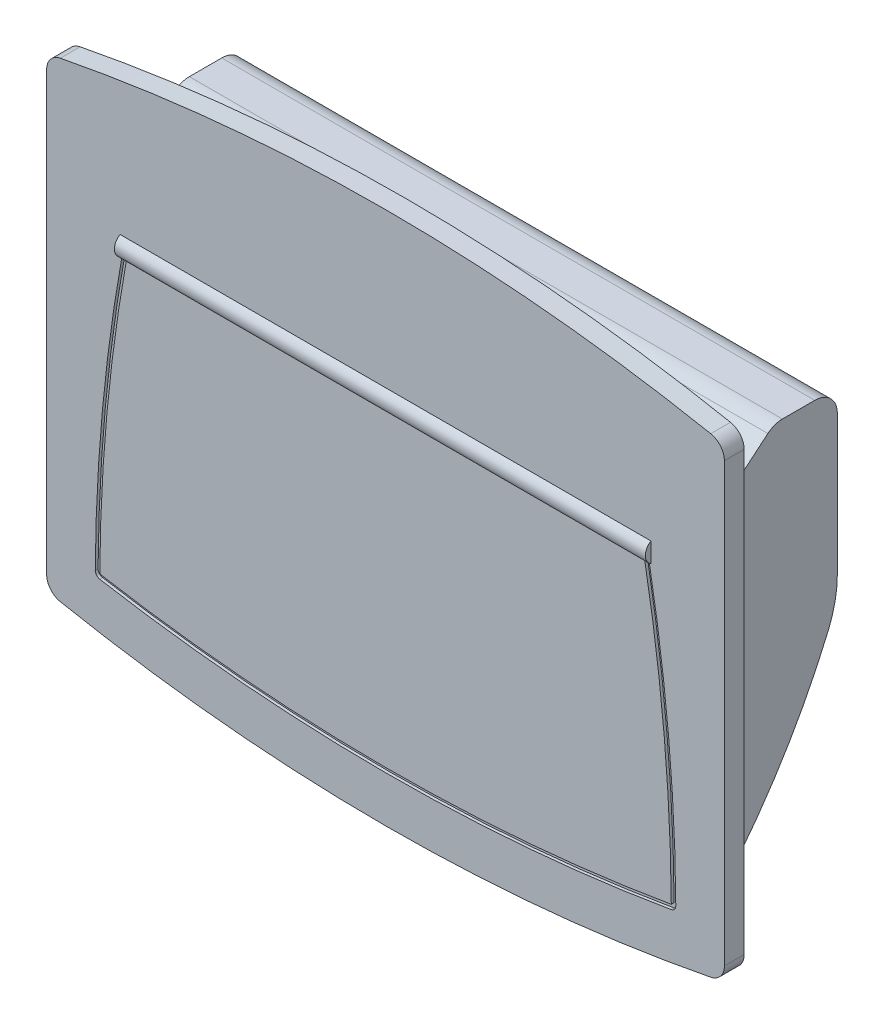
ISO-10303-21;
HEADER;
FILE_DESCRIPTION(('STEP AP214'),'2;1');
FILE_NAME('part.step','',(''),(''),'','','');
FILE_SCHEMA(('AUTOMOTIVE_DESIGN { 1 0 10303 214 1 1 1 1 }'));
ENDSEC;
DATA;
#1=APPLICATION_CONTEXT('core data for automotive mechanical design processes');
#2=APPLICATION_PROTOCOL_DEFINITION('international standard','automotive_design',2000,#1);
#3=PRODUCT_CONTEXT('',#1,'mechanical');
#4=PRODUCT('Part','Part','',(#3));
#5=PRODUCT_RELATED_PRODUCT_CATEGORY('part','',(#4));
#6=PRODUCT_DEFINITION_FORMATION('','',#4);
#7=PRODUCT_DEFINITION_CONTEXT('part definition',#1,'design');
#8=PRODUCT_DEFINITION('design','',#6,#7);
#9=PRODUCT_DEFINITION_SHAPE('','',#8);
#10=(LENGTH_UNIT() NAMED_UNIT(*) SI_UNIT(.MILLI.,.METRE.));
#11=(NAMED_UNIT(*) PLANE_ANGLE_UNIT() SI_UNIT($,.RADIAN.));
#12=(NAMED_UNIT(*) SI_UNIT($,.STERADIAN.) SOLID_ANGLE_UNIT());
#13=UNCERTAINTY_MEASURE_WITH_UNIT(LENGTH_MEASURE(1.E-05),#10,'distance_accuracy_value','');
#14=(GEOMETRIC_REPRESENTATION_CONTEXT(3) GLOBAL_UNCERTAINTY_ASSIGNED_CONTEXT((#13)) GLOBAL_UNIT_ASSIGNED_CONTEXT((#10,
#11,#12)) REPRESENTATION_CONTEXT('',''));
#15=CARTESIAN_POINT('',(0.,0.,0.));
#16=DIRECTION('',(0.,0.,1.));
#17=DIRECTION('',(1.,0.,0.));
#18=AXIS2_PLACEMENT_3D('',#15,#16,#17);
#19=CARTESIAN_POINT('',(-57.,-38.7289872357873,3.5));
#20=DIRECTION('',(0.,0.,1.));
#21=DIRECTION('',(1.,0.,0.));
#22=AXIS2_PLACEMENT_3D('',#19,#20,#21);
#23=PLANE('',#22);
#24=CARTESIAN_POINT('',(243.595334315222,-35.9783851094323,3.5));
#25=DIRECTION('',(0.,0.,1.));
#26=DIRECTION('',(1.,0.,0.));
#27=AXIS2_PLACEMENT_3D('',#24,#25,#26);
#28=CIRCLE('',#27,294.999999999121);
#29=CARTESIAN_POINT('',(-46.7051686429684,16.4679491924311,3.5));
#30=VERTEX_POINT('',#29);
#31=CARTESIAN_POINT('',(-51.396224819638,-33.746785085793,3.5));
#32=VERTEX_POINT('',#31);
#33=EDGE_CURVE('E367',#30,#32,#28,.T.);
#34=ORIENTED_EDGE('',*,*,#33,.F.);
#35=DIRECTION('',(1.,0.,0.));
#36=VECTOR('',#35,1.);
#37=CARTESIAN_POINT('',(-47.,16.4679491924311,3.5));
#38=LINE('',#37,#36);
#39=CARTESIAN_POINT('',(-47.,16.4679491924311,3.5));
#40=VERTEX_POINT('',#39);
#41=EDGE_CURVE('E791',#40,#30,#38,.T.);
#42=ORIENTED_EDGE('',*,*,#41,.F.);
#43=DIRECTION('',(0.,1.,0.));
#44=VECTOR('',#43,1.);
#45=CARTESIAN_POINT('',(-47.,-38.7289872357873,3.5));
#46=LINE('',#45,#44);
#47=CARTESIAN_POINT('',(-47.,19.9320508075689,3.5));
#48=VERTEX_POINT('',#47);
#49=EDGE_CURVE('E22',#40,#48,#46,.T.);
#50=ORIENTED_EDGE('',*,*,#49,.T.);
#51=DIRECTION('',(1.,0.,0.));
#52=VECTOR('',#51,1.);
#53=CARTESIAN_POINT('',(-47.,19.9320508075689,3.5));
#54=LINE('',#53,#52);
#55=CARTESIAN_POINT('',(47.,19.9320508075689,3.5));
#56=VERTEX_POINT('',#55);
#57=EDGE_CURVE('E787',#56,#48,#54,.F.);
#58=ORIENTED_EDGE('',*,*,#57,.F.);
#59=DIRECTION('',(0.,1.,0.));
#60=VECTOR('',#59,1.);
#61=CARTESIAN_POINT('',(47.,-38.7289872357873,3.5));
#62=LINE('',#61,#60);
#63=CARTESIAN_POINT('',(47.,16.4679491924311,3.5));
#64=VERTEX_POINT('',#63);
#65=EDGE_CURVE('E9',#64,#56,#62,.T.);
#66=ORIENTED_EDGE('',*,*,#65,.F.);
#67=CARTESIAN_POINT('',(46.7051686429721,16.4679491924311,3.5));
#68=VERTEX_POINT('',#67);
#69=EDGE_CURVE('E790',#68,#64,#38,.T.);
#70=ORIENTED_EDGE('',*,*,#69,.F.);
#71=CARTESIAN_POINT('',(-243.595334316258,-35.9783851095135,3.5));
#72=DIRECTION('',(0.,0.,1.));
#73=DIRECTION('',(1.,0.,0.));
#74=AXIS2_PLACEMENT_3D('',#71,#72,#73);
#75=CIRCLE('',#74,295.000000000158);
#76=CARTESIAN_POINT('',(51.396655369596,-33.804443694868,3.5));
#77=VERTEX_POINT('',#76);
#78=EDGE_CURVE('E37',#77,#68,#75,.T.);
#79=ORIENTED_EDGE('',*,*,#78,.F.);
#80=CARTESIAN_POINT('',(50.3966825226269,-33.81181290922,3.5));
#81=DIRECTION('',(0.,0.,1.));
#82=DIRECTION('',(-1.,0.,0.));
#83=AXIS2_PLACEMENT_3D('',#80,#81,#82);
#84=CIRCLE('',#83,0.999999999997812);
#85=CARTESIAN_POINT('',(50.566127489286,-34.797352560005,3.5));
#86=VERTEX_POINT('',#85);
#87=EDGE_CURVE('E400',#86,#77,#84,.T.);
#88=ORIENTED_EDGE('',*,*,#87,.F.);
#89=CARTESIAN_POINT('',(0.166756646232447,258.339583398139,3.5));
#90=DIRECTION('',(0.,0.,1.));
#91=DIRECTION('',(1.,0.,0.));
#92=AXIS2_PLACEMENT_3D('',#89,#90,#91);
#93=CIRCLE('',#92,297.437993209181);
#94=CARTESIAN_POINT('',(-50.566822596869,-34.739695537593,3.5));
#95=VERTEX_POINT('',#94);
#96=EDGE_CURVE('E394',#95,#86,#93,.T.);
#97=ORIENTED_EDGE('',*,*,#96,.F.);
#98=CARTESIAN_POINT('',(-50.3962534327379,-33.7543498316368,3.5));
#99=DIRECTION('',(0.,0.,1.));
#100=DIRECTION('',(1.,0.,0.));
#101=AXIS2_PLACEMENT_3D('',#98,#99,#100);
#102=CIRCLE('',#101,0.999999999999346);
#103=EDGE_CURVE('E383',#32,#95,#102,.T.);
#104=ORIENTED_EDGE('',*,*,#103,.F.);
#105=EDGE_LOOP('',(#34,#42,#50,#58,#66,#70,#79,#88,#97,#104));
#106=FACE_BOUND('',#105,.T.);
#107=DIRECTION('',(0.,-1.,0.));
#108=VECTOR('',#107,1.);
#109=CARTESIAN_POINT('',(-60.,38.728987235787,3.5));
#110=LINE('',#109,#108);
#111=CARTESIAN_POINT('',(-60.,38.728987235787,3.5));
#112=VERTEX_POINT('',#111);
#113=CARTESIAN_POINT('',(-60.,-38.728987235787,3.5));
#114=VERTEX_POINT('',#113);
#115=EDGE_CURVE('E669',#112,#114,#110,.T.);
#116=ORIENTED_EDGE('',*,*,#115,.T.);
#117=CARTESIAN_POINT('',(-57.,-38.7289872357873,3.5));
#118=DIRECTION('',(0.,0.,1.));
#119=DIRECTION('',(1.,0.,0.));
#120=AXIS2_PLACEMENT_3D('',#117,#118,#119);
#121=CIRCLE('',#120,2.99999999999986);
#122=CARTESIAN_POINT('',(-57.575757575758,-41.673219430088,3.5));
#123=VERTEX_POINT('',#122);
#124=EDGE_CURVE('E670',#114,#123,#121,.T.);
#125=ORIENTED_EDGE('',*,*,#124,.T.);
#126=CARTESIAN_POINT('',(0.,252.750000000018,3.5));
#127=DIRECTION('',(0.,0.,1.));
#128=DIRECTION('',(1.,0.,0.));
#129=AXIS2_PLACEMENT_3D('',#126,#127,#128);
#130=CIRCLE('',#129,300.000000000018);
#131=CARTESIAN_POINT('',(57.575757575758,-41.673219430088,3.5));
#132=VERTEX_POINT('',#131);
#133=EDGE_CURVE('E674',#123,#132,#130,.T.);
#134=ORIENTED_EDGE('',*,*,#133,.T.);
#135=CARTESIAN_POINT('',(57.,-38.7289872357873,3.5));
#136=DIRECTION('',(0.,0.,1.));
#137=DIRECTION('',(-1.,0.,0.));
#138=AXIS2_PLACEMENT_3D('',#135,#136,#137);
#139=CIRCLE('',#138,2.99999999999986);
#140=CARTESIAN_POINT('',(60.,-38.728987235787,3.5));
#141=VERTEX_POINT('',#140);
#142=EDGE_CURVE('E678',#132,#141,#139,.T.);
#143=ORIENTED_EDGE('',*,*,#142,.T.);
#144=DIRECTION('',(0.,1.,0.));
#145=VECTOR('',#144,1.);
#146=CARTESIAN_POINT('',(60.,-38.728987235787,3.5));
#147=LINE('',#146,#145);
#148=CARTESIAN_POINT('',(60.,38.728987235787,3.5));
#149=VERTEX_POINT('',#148);
#150=EDGE_CURVE('E682',#141,#149,#147,.T.);
#151=ORIENTED_EDGE('',*,*,#150,.T.);
#152=CARTESIAN_POINT('',(57.,38.7289872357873,3.5));
#153=DIRECTION('',(0.,0.,1.));
#154=DIRECTION('',(1.,0.,0.));
#155=AXIS2_PLACEMENT_3D('',#152,#153,#154);
#156=CIRCLE('',#155,2.99999999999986);
#157=CARTESIAN_POINT('',(57.575757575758,41.673219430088,3.5));
#158=VERTEX_POINT('',#157);
#159=EDGE_CURVE('E686',#149,#158,#156,.T.);
#160=ORIENTED_EDGE('',*,*,#159,.T.);
#161=CARTESIAN_POINT('',(0.,-252.750000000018,3.5));
#162=DIRECTION('',(0.,0.,1.));
#163=DIRECTION('',(1.,0.,0.));
#164=AXIS2_PLACEMENT_3D('',#161,#162,#163);
#165=CIRCLE('',#164,300.000000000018);
#166=CARTESIAN_POINT('',(-57.575757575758,41.673219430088,3.5));
#167=VERTEX_POINT('',#166);
#168=EDGE_CURVE('E690',#158,#167,#165,.T.);
#169=ORIENTED_EDGE('',*,*,#168,.T.);
#170=CARTESIAN_POINT('',(-57.,38.7289872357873,3.5));
#171=DIRECTION('',(0.,0.,1.));
#172=DIRECTION('',(1.,0.,0.));
#173=AXIS2_PLACEMENT_3D('',#170,#171,#172);
#174=CIRCLE('',#173,2.99999999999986);
#175=EDGE_CURVE('E694',#167,#112,#174,.T.);
#176=ORIENTED_EDGE('',*,*,#175,.T.);
#177=EDGE_LOOP('',(#116,#125,#134,#143,#151,#160,#169,#176));
#178=FACE_BOUND('',#177,.T.);
#179=ADVANCED_FACE('F14',(#106,#178),#23,.T.);
#180=CARTESIAN_POINT('',(-57.,-38.7289872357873,0.));
#181=DIRECTION('',(0.,0.,1.));
#182=DIRECTION('',(1.,0.,0.));
#183=AXIS2_PLACEMENT_3D('',#180,#181,#182);
#184=PLANE('',#183);
#185=DIRECTION('',(0.,-1.,0.));
#186=VECTOR('',#185,1.);
#187=CARTESIAN_POINT('',(-60.,38.728987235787,0.));
#188=LINE('',#187,#186);
#189=CARTESIAN_POINT('',(-60.,38.728987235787,0.));
#190=VERTEX_POINT('',#189);
#191=CARTESIAN_POINT('',(-60.,-38.728987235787,0.));
#192=VERTEX_POINT('',#191);
#193=EDGE_CURVE('E698',#190,#192,#188,.T.);
#194=ORIENTED_EDGE('',*,*,#193,.F.);
#195=CARTESIAN_POINT('',(-57.,38.7289872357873,0.));
#196=DIRECTION('',(0.,0.,1.));
#197=DIRECTION('',(1.,0.,0.));
#198=AXIS2_PLACEMENT_3D('',#195,#196,#197);
#199=CIRCLE('',#198,2.99999999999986);
#200=CARTESIAN_POINT('',(-57.575757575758,41.673219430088,0.));
#201=VERTEX_POINT('',#200);
#202=EDGE_CURVE('E720',#201,#190,#199,.T.);
#203=ORIENTED_EDGE('',*,*,#202,.F.);
#204=CARTESIAN_POINT('',(0.,-252.750000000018,0.));
#205=DIRECTION('',(0.,0.,1.));
#206=DIRECTION('',(1.,0.,0.));
#207=AXIS2_PLACEMENT_3D('',#204,#205,#206);
#208=CIRCLE('',#207,300.000000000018);
#209=CARTESIAN_POINT('',(57.575757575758,41.673219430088,0.));
#210=VERTEX_POINT('',#209);
#211=EDGE_CURVE('E717',#210,#201,#208,.T.);
#212=ORIENTED_EDGE('',*,*,#211,.F.);
#213=CARTESIAN_POINT('',(57.,38.7289872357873,0.));
#214=DIRECTION('',(0.,0.,1.));
#215=DIRECTION('',(1.,0.,0.));
#216=AXIS2_PLACEMENT_3D('',#213,#214,#215);
#217=CIRCLE('',#216,2.99999999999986);
#218=CARTESIAN_POINT('',(60.,38.728987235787,0.));
#219=VERTEX_POINT('',#218);
#220=EDGE_CURVE('E714',#219,#210,#217,.T.);
#221=ORIENTED_EDGE('',*,*,#220,.F.);
#222=DIRECTION('',(0.,1.,0.));
#223=VECTOR('',#222,1.);
#224=CARTESIAN_POINT('',(60.,-38.728987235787,0.));
#225=LINE('',#224,#223);
#226=CARTESIAN_POINT('',(60.,-38.728987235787,0.));
#227=VERTEX_POINT('',#226);
#228=EDGE_CURVE('E711',#227,#219,#225,.T.);
#229=ORIENTED_EDGE('',*,*,#228,.F.);
#230=CARTESIAN_POINT('',(57.,-38.7289872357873,0.));
#231=DIRECTION('',(0.,0.,1.));
#232=DIRECTION('',(-1.,0.,0.));
#233=AXIS2_PLACEMENT_3D('',#230,#231,#232);
#234=CIRCLE('',#233,2.99999999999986);
#235=CARTESIAN_POINT('',(57.575757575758,-41.673219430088,0.));
#236=VERTEX_POINT('',#235);
#237=EDGE_CURVE('E708',#236,#227,#234,.T.);
#238=ORIENTED_EDGE('',*,*,#237,.F.);
#239=CARTESIAN_POINT('',(0.,252.750000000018,0.));
#240=DIRECTION('',(0.,0.,1.));
#241=DIRECTION('',(1.,0.,0.));
#242=AXIS2_PLACEMENT_3D('',#239,#240,#241);
#243=CIRCLE('',#242,300.000000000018);
#244=CARTESIAN_POINT('',(-57.575757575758,-41.673219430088,0.));
#245=VERTEX_POINT('',#244);
#246=EDGE_CURVE('E705',#245,#236,#243,.T.);
#247=ORIENTED_EDGE('',*,*,#246,.F.);
#248=CARTESIAN_POINT('',(-57.,-38.7289872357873,0.));
#249=DIRECTION('',(0.,0.,1.));
#250=DIRECTION('',(1.,0.,0.));
#251=AXIS2_PLACEMENT_3D('',#248,#249,#250);
#252=CIRCLE('',#251,2.99999999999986);
#253=EDGE_CURVE('E702',#192,#245,#252,.T.);
#254=ORIENTED_EDGE('',*,*,#253,.F.);
#255=EDGE_LOOP('',(#194,#203,#212,#221,#229,#238,#247,#254));
#256=FACE_BOUND('',#255,.T.);
#257=DIRECTION('',(0.,-1.,0.));
#258=VECTOR('',#257,1.);
#259=CARTESIAN_POINT('',(40.,-38.7289872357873,0.));
#260=LINE('',#259,#258);
#261=CARTESIAN_POINT('',(40.,30.75,0.));
#262=VERTEX_POINT('',#261);
#263=CARTESIAN_POINT('',(40.,21.75,0.));
#264=VERTEX_POINT('',#263);
#265=EDGE_CURVE('E560',#262,#264,#260,.T.);
#266=ORIENTED_EDGE('',*,*,#265,.F.);
#267=DIRECTION('',(-1.,0.,0.));
#268=VECTOR('',#267,1.);
#269=CARTESIAN_POINT('',(-57.,30.75,0.));
#270=LINE('',#269,#268);
#271=CARTESIAN_POINT('',(38.,30.75,0.));
#272=VERTEX_POINT('',#271);
#273=EDGE_CURVE('E523',#262,#272,#270,.T.);
#274=ORIENTED_EDGE('',*,*,#273,.T.);
#275=DIRECTION('',(0.,1.,0.));
#276=VECTOR('',#275,1.);
#277=CARTESIAN_POINT('',(38.,-38.7289872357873,0.));
#278=LINE('',#277,#276);
#279=CARTESIAN_POINT('',(38.,21.75,0.));
#280=VERTEX_POINT('',#279);
#281=EDGE_CURVE('E557',#280,#272,#278,.T.);
#282=ORIENTED_EDGE('',*,*,#281,.F.);
#283=DIRECTION('',(1.,0.,0.));
#284=VECTOR('',#283,1.);
#285=CARTESIAN_POINT('',(-52.5,21.75,0.));
#286=LINE('',#285,#284);
#287=CARTESIAN_POINT('',(27.,21.75,0.));
#288=VERTEX_POINT('',#287);
#289=EDGE_CURVE('E2078',#288,#280,#286,.T.);
#290=ORIENTED_EDGE('',*,*,#289,.F.);
#291=DIRECTION('',(0.,-1.,0.));
#292=VECTOR('',#291,1.);
#293=CARTESIAN_POINT('',(27.,-38.7289872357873,0.));
#294=LINE('',#293,#292);
#295=CARTESIAN_POINT('',(27.,30.75,0.));
#296=VERTEX_POINT('',#295);
#297=EDGE_CURVE('E554',#296,#288,#294,.T.);
#298=ORIENTED_EDGE('',*,*,#297,.F.);
#299=CARTESIAN_POINT('',(25.,30.75,0.));
#300=VERTEX_POINT('',#299);
#301=EDGE_CURVE('E2043',#296,#300,#270,.T.);
#302=ORIENTED_EDGE('',*,*,#301,.T.);
#303=DIRECTION('',(0.,1.,0.));
#304=VECTOR('',#303,1.);
#305=CARTESIAN_POINT('',(25.,-38.7289872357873,0.));
#306=LINE('',#305,#304);
#307=CARTESIAN_POINT('',(25.,21.75,0.));
#308=VERTEX_POINT('',#307);
#309=EDGE_CURVE('E551',#308,#300,#306,.T.);
#310=ORIENTED_EDGE('',*,*,#309,.F.);
#311=CARTESIAN_POINT('',(14.,21.75,0.));
#312=VERTEX_POINT('',#311);
#313=EDGE_CURVE('E2074',#312,#308,#286,.T.);
#314=ORIENTED_EDGE('',*,*,#313,.F.);
#315=DIRECTION('',(0.,-1.,0.));
#316=VECTOR('',#315,1.);
#317=CARTESIAN_POINT('',(14.,-38.7289872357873,0.));
#318=LINE('',#317,#316);
#319=CARTESIAN_POINT('',(14.,30.75,0.));
#320=VERTEX_POINT('',#319);
#321=EDGE_CURVE('E548',#320,#312,#318,.T.);
#322=ORIENTED_EDGE('',*,*,#321,.F.);
#323=CARTESIAN_POINT('',(12.,30.75,0.));
#324=VERTEX_POINT('',#323);
#325=EDGE_CURVE('E2085',#320,#324,#270,.T.);
#326=ORIENTED_EDGE('',*,*,#325,.T.);
#327=DIRECTION('',(0.,1.,0.));
#328=VECTOR('',#327,1.);
#329=CARTESIAN_POINT('',(12.,-38.7289872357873,0.));
#330=LINE('',#329,#328);
#331=CARTESIAN_POINT('',(12.,21.75,0.));
#332=VERTEX_POINT('',#331);
#333=EDGE_CURVE('E545',#332,#324,#330,.T.);
#334=ORIENTED_EDGE('',*,*,#333,.F.);
#335=CARTESIAN_POINT('',(0.999999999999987,21.75,0.));
#336=VERTEX_POINT('',#335);
#337=EDGE_CURVE('E2070',#336,#332,#286,.T.);
#338=ORIENTED_EDGE('',*,*,#337,.F.);
#339=DIRECTION('',(0.,-1.,0.));
#340=VECTOR('',#339,1.);
#341=CARTESIAN_POINT('',(1.,-38.7289872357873,0.));
#342=LINE('',#341,#340);
#343=CARTESIAN_POINT('',(1.,30.75,0.));
#344=VERTEX_POINT('',#343);
#345=EDGE_CURVE('E542',#344,#336,#342,.T.);
#346=ORIENTED_EDGE('',*,*,#345,.F.);
#347=CARTESIAN_POINT('',(-1.,30.75,0.));
#348=VERTEX_POINT('',#347);
#349=EDGE_CURVE('E2086',#344,#348,#270,.T.);
#350=ORIENTED_EDGE('',*,*,#349,.T.);
#351=DIRECTION('',(0.,1.,0.));
#352=VECTOR('',#351,1.);
#353=CARTESIAN_POINT('',(-1.,-38.7289872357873,0.));
#354=LINE('',#353,#352);
#355=CARTESIAN_POINT('',(-1.00000000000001,21.75,0.));
#356=VERTEX_POINT('',#355);
#357=EDGE_CURVE('E539',#356,#348,#354,.T.);
#358=ORIENTED_EDGE('',*,*,#357,.F.);
#359=CARTESIAN_POINT('',(-12.,21.75,0.));
#360=VERTEX_POINT('',#359);
#361=EDGE_CURVE('E2066',#360,#356,#286,.T.);
#362=ORIENTED_EDGE('',*,*,#361,.F.);
#363=DIRECTION('',(0.,-1.,0.));
#364=VECTOR('',#363,1.);
#365=CARTESIAN_POINT('',(-12.,-38.7289872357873,0.));
#366=LINE('',#365,#364);
#367=CARTESIAN_POINT('',(-12.,30.75,0.));
#368=VERTEX_POINT('',#367);
#369=EDGE_CURVE('E536',#368,#360,#366,.T.);
#370=ORIENTED_EDGE('',*,*,#369,.F.);
#371=CARTESIAN_POINT('',(-14.,30.75,0.));
#372=VERTEX_POINT('',#371);
#373=EDGE_CURVE('E2088',#368,#372,#270,.T.);
#374=ORIENTED_EDGE('',*,*,#373,.T.);
#375=DIRECTION('',(0.,1.,0.));
#376=VECTOR('',#375,1.);
#377=CARTESIAN_POINT('',(-14.,-38.7289872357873,0.));
#378=LINE('',#377,#376);
#379=CARTESIAN_POINT('',(-14.,21.75,0.));
#380=VERTEX_POINT('',#379);
#381=EDGE_CURVE('E533',#380,#372,#378,.T.);
#382=ORIENTED_EDGE('',*,*,#381,.F.);
#383=CARTESIAN_POINT('',(-25.,21.75,0.));
#384=VERTEX_POINT('',#383);
#385=EDGE_CURVE('E2064',#384,#380,#286,.T.);
#386=ORIENTED_EDGE('',*,*,#385,.F.);
#387=DIRECTION('',(0.,-1.,0.));
#388=VECTOR('',#387,1.);
#389=CARTESIAN_POINT('',(-25.,-38.7289872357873,0.));
#390=LINE('',#389,#388);
#391=CARTESIAN_POINT('',(-25.,30.75,0.));
#392=VERTEX_POINT('',#391);
#393=EDGE_CURVE('E530',#392,#384,#390,.T.);
#394=ORIENTED_EDGE('',*,*,#393,.F.);
#395=CARTESIAN_POINT('',(-27.,30.75,0.));
#396=VERTEX_POINT('',#395);
#397=EDGE_CURVE('E522',#392,#396,#270,.T.);
#398=ORIENTED_EDGE('',*,*,#397,.T.);
#399=DIRECTION('',(0.,1.,0.));
#400=VECTOR('',#399,1.);
#401=CARTESIAN_POINT('',(-27.,-38.7289872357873,0.));
#402=LINE('',#401,#400);
#403=CARTESIAN_POINT('',(-27.,21.75,0.));
#404=VERTEX_POINT('',#403);
#405=EDGE_CURVE('E527',#404,#396,#402,.T.);
#406=ORIENTED_EDGE('',*,*,#405,.F.);
#407=CARTESIAN_POINT('',(-38.,21.75,0.));
#408=VERTEX_POINT('',#407);
#409=EDGE_CURVE('E655',#408,#404,#286,.T.);
#410=ORIENTED_EDGE('',*,*,#409,.F.);
#411=DIRECTION('',(0.,-1.,0.));
#412=VECTOR('',#411,1.);
#413=CARTESIAN_POINT('',(-38.,-38.7289872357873,0.));
#414=LINE('',#413,#412);
#415=CARTESIAN_POINT('',(-38.,30.75,0.));
#416=VERTEX_POINT('',#415);
#417=EDGE_CURVE('E524',#416,#408,#414,.T.);
#418=ORIENTED_EDGE('',*,*,#417,.F.);
#419=CARTESIAN_POINT('',(-40.,30.75,0.));
#420=VERTEX_POINT('',#419);
#421=EDGE_CURVE('E518',#416,#420,#270,.T.);
#422=ORIENTED_EDGE('',*,*,#421,.T.);
#423=DIRECTION('',(0.,1.,0.));
#424=VECTOR('',#423,1.);
#425=CARTESIAN_POINT('',(-40.,-38.7289872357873,0.));
#426=LINE('',#425,#424);
#427=CARTESIAN_POINT('',(-40.,21.75,0.));
#428=VERTEX_POINT('',#427);
#429=EDGE_CURVE('E563',#428,#420,#426,.T.);
#430=ORIENTED_EDGE('',*,*,#429,.F.);
#431=CARTESIAN_POINT('',(-52.5,21.75,0.));
#432=VERTEX_POINT('',#431);
#433=EDGE_CURVE('E651',#432,#428,#286,.T.);
#434=ORIENTED_EDGE('',*,*,#433,.F.);
#435=DIRECTION('',(0.,-1.,0.));
#436=VECTOR('',#435,1.);
#437=CARTESIAN_POINT('',(-52.5,21.75,0.));
#438=LINE('',#437,#436);
#439=CARTESIAN_POINT('',(-52.5,-38.2,0.));
#440=VERTEX_POINT('',#439);
#441=EDGE_CURVE('E625',#432,#440,#438,.T.);
#442=ORIENTED_EDGE('',*,*,#441,.T.);
#443=DIRECTION('',(1.,0.,0.));
#444=VECTOR('',#443,1.);
#445=CARTESIAN_POINT('',(-52.5,-38.2,0.));
#446=LINE('',#445,#444);
#447=CARTESIAN_POINT('',(52.5,-38.2,0.));
#448=VERTEX_POINT('',#447);
#449=EDGE_CURVE('E667',#440,#448,#446,.T.);
#450=ORIENTED_EDGE('',*,*,#449,.T.);
#451=DIRECTION('',(0.,-1.,0.));
#452=VECTOR('',#451,1.);
#453=CARTESIAN_POINT('',(52.5,21.75,0.));
#454=LINE('',#453,#452);
#455=CARTESIAN_POINT('',(52.5,21.75,0.));
#456=VERTEX_POINT('',#455);
#457=EDGE_CURVE('E603',#456,#448,#454,.T.);
#458=ORIENTED_EDGE('',*,*,#457,.F.);
#459=EDGE_CURVE('E648',#264,#456,#286,.T.);
#460=ORIENTED_EDGE('',*,*,#459,.F.);
#461=EDGE_LOOP('',(#266,#274,#282,#290,#298,#302,#310,#314,#322,#326,#334,#338,#346,#350,#358,
#362,#370,#374,#382,#386,#394,#398,#406,#410,#418,#422,#430,#434,#442,#450,#458,#460));
#462=FACE_BOUND('',#461,.T.);
#463=ADVANCED_FACE('F815',(#256,#462),#184,.F.);
#464=CARTESIAN_POINT('',(-52.5,31.564177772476,-11.696081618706));
#465=DIRECTION('',(0.,0.766044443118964,0.642787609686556));
#466=DIRECTION('',(0.,-0.642787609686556,0.766044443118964));
#467=AXIS2_PLACEMENT_3D('',#464,#465,#466);
#468=PLANE('',#467);
#469=DIRECTION('',(-1.,0.,0.));
#470=VECTOR('',#469,1.);
#471=CARTESIAN_POINT('',(-52.5,30.75,-10.7257823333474));
#472=LINE('',#471,#470);
#473=CARTESIAN_POINT('',(40.,30.75,-10.7257823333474));
#474=VERTEX_POINT('',#473);
#475=CARTESIAN_POINT('',(38.,30.75,-10.7257823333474));
#476=VERTEX_POINT('',#475);
#477=EDGE_CURVE('E754',#474,#476,#472,.T.);
#478=ORIENTED_EDGE('',*,*,#477,.F.);
#479=DIRECTION('',(0.,-0.642787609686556,0.766044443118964));
#480=VECTOR('',#479,1.);
#481=CARTESIAN_POINT('',(40.,31.564177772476,-11.696081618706));
#482=LINE('',#481,#480);
#483=EDGE_CURVE('E785',#474,#264,#482,.T.);
#484=ORIENTED_EDGE('',*,*,#483,.T.);
#485=ORIENTED_EDGE('',*,*,#459,.T.);
#486=DIRECTION('',(0.,-0.642787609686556,0.766044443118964));
#487=VECTOR('',#486,1.);
#488=CARTESIAN_POINT('',(52.5,31.564177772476,-11.696081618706));
#489=LINE('',#488,#487);
#490=CARTESIAN_POINT('',(52.5,31.564177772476,-11.696081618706));
#491=VERTEX_POINT('',#490);
#492=EDGE_CURVE('E622',#491,#456,#489,.T.);
#493=ORIENTED_EDGE('',*,*,#492,.F.);
#494=DIRECTION('',(1.,0.,0.));
#495=VECTOR('',#494,1.);
#496=CARTESIAN_POINT('',(-52.5,31.564177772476,-11.696081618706));
#497=LINE('',#496,#495);
#498=CARTESIAN_POINT('',(-52.5,31.564177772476,-11.696081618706));
#499=VERTEX_POINT('',#498);
#500=EDGE_CURVE('E654',#499,#491,#497,.T.);
#501=ORIENTED_EDGE('',*,*,#500,.F.);
#502=DIRECTION('',(0.,-0.642787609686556,0.766044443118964));
#503=VECTOR('',#502,1.);
#504=CARTESIAN_POINT('',(-52.5,31.564177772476,-11.696081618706));
#505=LINE('',#504,#503);
#506=EDGE_CURVE('E646',#499,#432,#505,.T.);
#507=ORIENTED_EDGE('',*,*,#506,.T.);
#508=ORIENTED_EDGE('',*,*,#433,.T.);
#509=DIRECTION('',(0.,0.642787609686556,-0.766044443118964));
#510=VECTOR('',#509,1.);
#511=CARTESIAN_POINT('',(-40.,31.564177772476,-11.696081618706));
#512=LINE('',#511,#510);
#513=CARTESIAN_POINT('',(-40.,30.75,-10.7257823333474));
#514=VERTEX_POINT('',#513);
#515=EDGE_CURVE('E757',#428,#514,#512,.T.);
#516=ORIENTED_EDGE('',*,*,#515,.T.);
#517=CARTESIAN_POINT('',(-38.,30.75,-10.7257823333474));
#518=VERTEX_POINT('',#517);
#519=EDGE_CURVE('E750',#518,#514,#472,.T.);
#520=ORIENTED_EDGE('',*,*,#519,.F.);
#521=DIRECTION('',(0.,-0.642787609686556,0.766044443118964));
#522=VECTOR('',#521,1.);
#523=CARTESIAN_POINT('',(-38.,31.564177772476,-11.696081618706));
#524=LINE('',#523,#522);
#525=EDGE_CURVE('E753',#518,#408,#524,.T.);
#526=ORIENTED_EDGE('',*,*,#525,.T.);
#527=ORIENTED_EDGE('',*,*,#409,.T.);
#528=DIRECTION('',(0.,0.642787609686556,-0.766044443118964));
#529=VECTOR('',#528,1.);
#530=CARTESIAN_POINT('',(-27.,31.564177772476,-11.696081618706));
#531=LINE('',#530,#529);
#532=CARTESIAN_POINT('',(-27.,30.75,-10.7257823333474));
#533=VERTEX_POINT('',#532);
#534=EDGE_CURVE('E759',#404,#533,#531,.T.);
#535=ORIENTED_EDGE('',*,*,#534,.T.);
#536=CARTESIAN_POINT('',(-25.,30.75,-10.7257823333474));
#537=VERTEX_POINT('',#536);
#538=EDGE_CURVE('E755',#537,#533,#472,.T.);
#539=ORIENTED_EDGE('',*,*,#538,.F.);
#540=DIRECTION('',(0.,-0.642787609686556,0.766044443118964));
#541=VECTOR('',#540,1.);
#542=CARTESIAN_POINT('',(-25.,31.564177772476,-11.696081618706));
#543=LINE('',#542,#541);
#544=EDGE_CURVE('E761',#537,#384,#543,.T.);
#545=ORIENTED_EDGE('',*,*,#544,.T.);
#546=ORIENTED_EDGE('',*,*,#385,.T.);
#547=DIRECTION('',(0.,0.642787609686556,-0.766044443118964));
#548=VECTOR('',#547,1.);
#549=CARTESIAN_POINT('',(-14.,31.564177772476,-11.696081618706));
#550=LINE('',#549,#548);
#551=CARTESIAN_POINT('',(-14.,30.75,-10.7257823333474));
#552=VERTEX_POINT('',#551);
#553=EDGE_CURVE('E764',#380,#552,#550,.T.);
#554=ORIENTED_EDGE('',*,*,#553,.T.);
#555=CARTESIAN_POINT('',(-12.,30.75,-10.7257823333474));
#556=VERTEX_POINT('',#555);
#557=EDGE_CURVE('E763',#556,#552,#472,.T.);
#558=ORIENTED_EDGE('',*,*,#557,.F.);
#559=DIRECTION('',(0.,-0.642787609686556,0.766044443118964));
#560=VECTOR('',#559,1.);
#561=CARTESIAN_POINT('',(-12.,31.564177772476,-11.696081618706));
#562=LINE('',#561,#560);
#563=EDGE_CURVE('E766',#556,#360,#562,.T.);
#564=ORIENTED_EDGE('',*,*,#563,.T.);
#565=ORIENTED_EDGE('',*,*,#361,.T.);
#566=DIRECTION('',(0.,0.642787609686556,-0.766044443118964));
#567=VECTOR('',#566,1.);
#568=CARTESIAN_POINT('',(-1.,31.564177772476,-11.696081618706));
#569=LINE('',#568,#567);
#570=CARTESIAN_POINT('',(-1.,30.75,-10.7257823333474));
#571=VERTEX_POINT('',#570);
#572=EDGE_CURVE('E769',#356,#571,#569,.T.);
#573=ORIENTED_EDGE('',*,*,#572,.T.);
#574=CARTESIAN_POINT('',(0.999999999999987,30.75,-10.7257823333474));
#575=VERTEX_POINT('',#574);
#576=EDGE_CURVE('E768',#575,#571,#472,.T.);
#577=ORIENTED_EDGE('',*,*,#576,.F.);
#578=DIRECTION('',(0.,-0.642787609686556,0.766044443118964));
#579=VECTOR('',#578,1.);
#580=CARTESIAN_POINT('',(1.,31.564177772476,-11.696081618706));
#581=LINE('',#580,#579);
#582=EDGE_CURVE('E771',#575,#336,#581,.T.);
#583=ORIENTED_EDGE('',*,*,#582,.T.);
#584=ORIENTED_EDGE('',*,*,#337,.T.);
#585=DIRECTION('',(0.,0.642787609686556,-0.766044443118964));
#586=VECTOR('',#585,1.);
#587=CARTESIAN_POINT('',(12.,31.564177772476,-11.696081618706));
#588=LINE('',#587,#586);
#589=CARTESIAN_POINT('',(12.,30.75,-10.7257823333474));
#590=VERTEX_POINT('',#589);
#591=EDGE_CURVE('E774',#332,#590,#588,.T.);
#592=ORIENTED_EDGE('',*,*,#591,.T.);
#593=CARTESIAN_POINT('',(14.,30.75,-10.7257823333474));
#594=VERTEX_POINT('',#593);
#595=EDGE_CURVE('E773',#594,#590,#472,.T.);
#596=ORIENTED_EDGE('',*,*,#595,.F.);
#597=DIRECTION('',(0.,-0.642787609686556,0.766044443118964));
#598=VECTOR('',#597,1.);
#599=CARTESIAN_POINT('',(14.,31.564177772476,-11.696081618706));
#600=LINE('',#599,#598);
#601=EDGE_CURVE('E776',#594,#312,#600,.T.);
#602=ORIENTED_EDGE('',*,*,#601,.T.);
#603=ORIENTED_EDGE('',*,*,#313,.T.);
#604=DIRECTION('',(0.,0.642787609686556,-0.766044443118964));
#605=VECTOR('',#604,1.);
#606=CARTESIAN_POINT('',(25.,31.564177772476,-11.696081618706));
#607=LINE('',#606,#605);
#608=CARTESIAN_POINT('',(25.,30.75,-10.7257823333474));
#609=VERTEX_POINT('',#608);
#610=EDGE_CURVE('E779',#308,#609,#607,.T.);
#611=ORIENTED_EDGE('',*,*,#610,.T.);
#612=CARTESIAN_POINT('',(27.,30.75,-10.7257823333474));
#613=VERTEX_POINT('',#612);
#614=EDGE_CURVE('E778',#613,#609,#472,.T.);
#615=ORIENTED_EDGE('',*,*,#614,.F.);
#616=DIRECTION('',(0.,-0.642787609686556,0.766044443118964));
#617=VECTOR('',#616,1.);
#618=CARTESIAN_POINT('',(27.,31.564177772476,-11.696081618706));
#619=LINE('',#618,#617);
#620=EDGE_CURVE('E781',#613,#288,#619,.T.);
#621=ORIENTED_EDGE('',*,*,#620,.T.);
#622=ORIENTED_EDGE('',*,*,#289,.T.);
#623=DIRECTION('',(0.,0.642787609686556,-0.766044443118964));
#624=VECTOR('',#623,1.);
#625=CARTESIAN_POINT('',(38.,31.564177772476,-11.696081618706));
#626=LINE('',#625,#624);
#627=EDGE_CURVE('E783',#280,#476,#626,.T.);
#628=ORIENTED_EDGE('',*,*,#627,.T.);
#629=EDGE_LOOP('',(#478,#484,#485,#493,#501,#507,#508,#516,#520,#526,#527,#535,#539,#545,#546,
#554,#558,#564,#565,#573,#577,#583,#584,#592,#596,#602,#603,#611,#615,#621,#622,#628));
#630=FACE_BOUND('',#629,.T.);
#631=ADVANCED_FACE('F822',(#630),#468,.T.);
#632=CARTESIAN_POINT('',(-52.5,40.8904239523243,83.4847581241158));
#633=DIRECTION('',(1.,0.,0.));
#634=DIRECTION('',(0.,0.,-1.));
#635=AXIS2_PLACEMENT_3D('',#632,#633,#634);
#636=CYLINDRICAL_SURFACE('',#635,115.000000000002);
#637=DIRECTION('',(1.,0.,0.));
#638=VECTOR('',#637,1.);
#639=CARTESIAN_POINT('',(-52.5,-3.93857227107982,-22.417843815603));
#640=LINE('',#639,#638);
#641=CARTESIAN_POINT('',(-52.5,-3.93857227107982,-22.417843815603));
#642=VERTEX_POINT('',#641);
#643=CARTESIAN_POINT('',(52.5,-3.93857227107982,-22.417843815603));
#644=VERTEX_POINT('',#643);
#645=EDGE_CURVE('E665',#642,#644,#640,.T.);
#646=ORIENTED_EDGE('',*,*,#645,.T.);
#647=CARTESIAN_POINT('',(52.5,40.8904239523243,83.4847581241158));
#648=DIRECTION('',(1.,0.,0.));
#649=DIRECTION('',(0.,1.,0.));
#650=AXIS2_PLACEMENT_3D('',#647,#648,#649);
#651=CIRCLE('',#650,115.000000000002);
#652=EDGE_CURVE('E604',#448,#644,#651,.T.);
#653=ORIENTED_EDGE('',*,*,#652,.F.);
#654=ORIENTED_EDGE('',*,*,#449,.F.);
#655=CARTESIAN_POINT('',(-52.5,40.8904239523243,83.4847581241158));
#656=DIRECTION('',(1.,0.,0.));
#657=DIRECTION('',(0.,1.,0.));
#658=AXIS2_PLACEMENT_3D('',#655,#656,#657);
#659=CIRCLE('',#658,115.000000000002);
#660=EDGE_CURVE('E628',#440,#642,#659,.T.);
#661=ORIENTED_EDGE('',*,*,#660,.T.);
#662=EDGE_LOOP('',(#646,#653,#654,#661));
#663=FACE_BOUND('',#662,.T.);
#664=DIRECTION('',(1.,0.,0.));
#665=VECTOR('',#664,1.);
#666=CARTESIAN_POINT('',(-52.5,-38.0906622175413,-0.10344694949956));
#667=LINE('',#666,#665);
#668=CARTESIAN_POINT('',(50.,-38.0906622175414,-0.103446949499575));
#669=VERTEX_POINT('',#668);
#670=CARTESIAN_POINT('',(-50.,-38.0906622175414,-0.103446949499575));
#671=VERTEX_POINT('',#670);
#672=EDGE_CURVE('E743',#669,#671,#667,.F.);
#673=ORIENTED_EDGE('',*,*,#672,.F.);
#674=CARTESIAN_POINT('',(50.,40.8904239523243,83.4847581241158));
#675=DIRECTION('',(-1.,0.,0.));
#676=DIRECTION('',(0.,-1.,0.));
#677=AXIS2_PLACEMENT_3D('',#674,#675,#676);
#678=CIRCLE('',#677,115.000000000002);
#679=CARTESIAN_POINT('',(50.,-29.8773811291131,-7.1624578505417));
#680=VERTEX_POINT('',#679);
#681=EDGE_CURVE('E747',#669,#680,#678,.F.);
#682=ORIENTED_EDGE('',*,*,#681,.T.);
#683=DIRECTION('',(1.,0.,0.));
#684=VECTOR('',#683,1.);
#685=CARTESIAN_POINT('',(-52.5,-29.877381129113,-7.16245785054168));
#686=LINE('',#685,#684);
#687=CARTESIAN_POINT('',(-50.,-29.8773811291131,-7.1624578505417));
#688=VERTEX_POINT('',#687);
#689=EDGE_CURVE('E741',#688,#680,#686,.T.);
#690=ORIENTED_EDGE('',*,*,#689,.F.);
#691=CARTESIAN_POINT('',(-50.,40.8904239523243,83.4847581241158));
#692=DIRECTION('',(-1.,0.,0.));
#693=DIRECTION('',(0.,-1.,0.));
#694=AXIS2_PLACEMENT_3D('',#691,#692,#693);
#695=CIRCLE('',#694,115.000000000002);
#696=EDGE_CURVE('E745',#671,#688,#695,.F.);
#697=ORIENTED_EDGE('',*,*,#696,.F.);
#698=EDGE_LOOP('',(#673,#682,#690,#697));
#699=FACE_BOUND('',#698,.T.);
#700=ADVANCED_FACE('F1417',(#663,#699),#636,.T.);
#701=CARTESIAN_POINT('',(-60.,38.728987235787,0.));
#702=DIRECTION('',(-1.,0.,0.));
#703=DIRECTION('',(0.,0.,1.));
#704=AXIS2_PLACEMENT_3D('',#701,#702,#703);
#705=PLANE('',#704);
#706=ORIENTED_EDGE('',*,*,#115,.F.);
#707=DIRECTION('',(0.,0.,1.));
#708=VECTOR('',#707,1.);
#709=CARTESIAN_POINT('',(-60.,38.728987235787,0.));
#710=LINE('',#709,#708);
#711=EDGE_CURVE('E723',#190,#112,#710,.T.);
#712=ORIENTED_EDGE('',*,*,#711,.F.);
#713=ORIENTED_EDGE('',*,*,#193,.T.);
#714=DIRECTION('',(0.,0.,1.));
#715=VECTOR('',#714,1.);
#716=CARTESIAN_POINT('',(-60.,-38.728987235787,0.));
#717=LINE('',#716,#715);
#718=EDGE_CURVE('E739',#192,#114,#717,.T.);
#719=ORIENTED_EDGE('',*,*,#718,.T.);
#720=EDGE_LOOP('',(#706,#712,#713,#719));
#721=FACE_BOUND('',#720,.T.);
#722=ADVANCED_FACE('F16',(#721),#705,.T.);
#723=CARTESIAN_POINT('',(-57.,-38.7289872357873,0.));
#724=DIRECTION('',(0.,0.,1.));
#725=DIRECTION('',(1.,0.,0.));
#726=AXIS2_PLACEMENT_3D('',#723,#724,#725);
#727=CYLINDRICAL_SURFACE('',#726,2.99999999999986);
#728=ORIENTED_EDGE('',*,*,#124,.F.);
#729=ORIENTED_EDGE('',*,*,#718,.F.);
#730=ORIENTED_EDGE('',*,*,#253,.T.);
#731=DIRECTION('',(0.,0.,1.));
#732=VECTOR('',#731,1.);
#733=CARTESIAN_POINT('',(-57.575757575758,-41.673219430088,0.));
#734=LINE('',#733,#732);
#735=EDGE_CURVE('E737',#245,#123,#734,.T.);
#736=ORIENTED_EDGE('',*,*,#735,.T.);
#737=EDGE_LOOP('',(#728,#729,#730,#736));
#738=FACE_BOUND('',#737,.T.);
#739=ADVANCED_FACE('F1578',(#738),#727,.T.);
#740=CARTESIAN_POINT('',(0.,252.750000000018,0.));
#741=DIRECTION('',(0.,0.,1.));
#742=DIRECTION('',(1.,0.,0.));
#743=AXIS2_PLACEMENT_3D('',#740,#741,#742);
#744=CYLINDRICAL_SURFACE('',#743,300.000000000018);
#745=ORIENTED_EDGE('',*,*,#133,.F.);
#746=ORIENTED_EDGE('',*,*,#735,.F.);
#747=ORIENTED_EDGE('',*,*,#246,.T.);
#748=DIRECTION('',(0.,0.,1.));
#749=VECTOR('',#748,1.);
#750=CARTESIAN_POINT('',(57.575757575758,-41.673219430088,0.));
#751=LINE('',#750,#749);
#752=EDGE_CURVE('E735',#236,#132,#751,.T.);
#753=ORIENTED_EDGE('',*,*,#752,.T.);
#754=EDGE_LOOP('',(#745,#746,#747,#753));
#755=FACE_BOUND('',#754,.T.);
#756=ADVANCED_FACE('F1586',(#755),#744,.T.);
#757=CARTESIAN_POINT('',(57.,-38.7289872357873,0.));
#758=DIRECTION('',(0.,0.,1.));
#759=DIRECTION('',(1.,0.,0.));
#760=AXIS2_PLACEMENT_3D('',#757,#758,#759);
#761=CYLINDRICAL_SURFACE('',#760,2.99999999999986);
#762=ORIENTED_EDGE('',*,*,#142,.F.);
#763=ORIENTED_EDGE('',*,*,#752,.F.);
#764=ORIENTED_EDGE('',*,*,#237,.T.);
#765=DIRECTION('',(0.,0.,1.));
#766=VECTOR('',#765,1.);
#767=CARTESIAN_POINT('',(60.,-38.728987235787,0.));
#768=LINE('',#767,#766);
#769=EDGE_CURVE('E733',#227,#141,#768,.T.);
#770=ORIENTED_EDGE('',*,*,#769,.T.);
#771=EDGE_LOOP('',(#762,#763,#764,#770));
#772=FACE_BOUND('',#771,.T.);
#773=ADVANCED_FACE('F1595',(#772),#761,.T.);
#774=CARTESIAN_POINT('',(60.,-38.728987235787,0.));
#775=DIRECTION('',(1.,0.,0.));
#776=DIRECTION('',(0.,0.,-1.));
#777=AXIS2_PLACEMENT_3D('',#774,#775,#776);
#778=PLANE('',#777);
#779=ORIENTED_EDGE('',*,*,#150,.F.);
#780=ORIENTED_EDGE('',*,*,#769,.F.);
#781=ORIENTED_EDGE('',*,*,#228,.T.);
#782=DIRECTION('',(0.,0.,1.));
#783=VECTOR('',#782,1.);
#784=CARTESIAN_POINT('',(60.,38.728987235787,0.));
#785=LINE('',#784,#783);
#786=EDGE_CURVE('E731',#219,#149,#785,.T.);
#787=ORIENTED_EDGE('',*,*,#786,.T.);
#788=EDGE_LOOP('',(#779,#780,#781,#787));
#789=FACE_BOUND('',#788,.T.);
#790=ADVANCED_FACE('F1605',(#789),#778,.T.);
#791=CARTESIAN_POINT('',(57.,38.7289872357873,0.));
#792=DIRECTION('',(0.,0.,1.));
#793=DIRECTION('',(1.,0.,0.));
#794=AXIS2_PLACEMENT_3D('',#791,#792,#793);
#795=CYLINDRICAL_SURFACE('',#794,2.99999999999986);
#796=ORIENTED_EDGE('',*,*,#159,.F.);
#797=ORIENTED_EDGE('',*,*,#786,.F.);
#798=ORIENTED_EDGE('',*,*,#220,.T.);
#799=DIRECTION('',(0.,0.,1.));
#800=VECTOR('',#799,1.);
#801=CARTESIAN_POINT('',(57.575757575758,41.673219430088,0.));
#802=LINE('',#801,#800);
#803=EDGE_CURVE('E729',#210,#158,#802,.T.);
#804=ORIENTED_EDGE('',*,*,#803,.T.);
#805=EDGE_LOOP('',(#796,#797,#798,#804));
#806=FACE_BOUND('',#805,.T.);
#807=ADVANCED_FACE('F1615',(#806),#795,.T.);
#808=CARTESIAN_POINT('',(0.,-252.750000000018,0.));
#809=DIRECTION('',(0.,0.,1.));
#810=DIRECTION('',(1.,0.,0.));
#811=AXIS2_PLACEMENT_3D('',#808,#809,#810);
#812=CYLINDRICAL_SURFACE('',#811,300.000000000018);
#813=ORIENTED_EDGE('',*,*,#168,.F.);
#814=ORIENTED_EDGE('',*,*,#803,.F.);
#815=ORIENTED_EDGE('',*,*,#211,.T.);
#816=DIRECTION('',(0.,0.,1.));
#817=VECTOR('',#816,1.);
#818=CARTESIAN_POINT('',(-57.575757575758,41.673219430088,0.));
#819=LINE('',#818,#817);
#820=EDGE_CURVE('E727',#201,#167,#819,.T.);
#821=ORIENTED_EDGE('',*,*,#820,.T.);
#822=EDGE_LOOP('',(#813,#814,#815,#821));
#823=FACE_BOUND('',#822,.T.);
#824=ADVANCED_FACE('F1625',(#823),#812,.T.);
#825=CARTESIAN_POINT('',(-57.,38.7289872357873,0.));
#826=DIRECTION('',(0.,0.,1.));
#827=DIRECTION('',(1.,0.,0.));
#828=AXIS2_PLACEMENT_3D('',#825,#826,#827);
#829=CYLINDRICAL_SURFACE('',#828,2.99999999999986);
#830=ORIENTED_EDGE('',*,*,#175,.F.);
#831=ORIENTED_EDGE('',*,*,#820,.F.);
#832=ORIENTED_EDGE('',*,*,#202,.T.);
#833=ORIENTED_EDGE('',*,*,#711,.T.);
#834=EDGE_LOOP('',(#830,#831,#832,#833));
#835=FACE_BOUND('',#834,.T.);
#836=ADVANCED_FACE('F1568',(#835),#829,.T.);
#837=CARTESIAN_POINT('',(-52.5,3.85777489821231,-3.99999999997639));
#838=DIRECTION('',(1.,0.,0.));
#839=DIRECTION('',(0.,0.,-1.));
#840=AXIS2_PLACEMENT_3D('',#837,#838,#839);
#841=CYLINDRICAL_SURFACE('',#840,20.0000000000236);
#842=DIRECTION('',(1.,0.,0.));
#843=VECTOR('',#842,1.);
#844=CARTESIAN_POINT('',(-52.5,3.8577748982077,-24.));
#845=LINE('',#844,#843);
#846=CARTESIAN_POINT('',(-52.5,3.8577748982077,-24.));
#847=VERTEX_POINT('',#846);
#848=CARTESIAN_POINT('',(52.5,3.8577748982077,-24.));
#849=VERTEX_POINT('',#848);
#850=EDGE_CURVE('E663',#847,#849,#845,.T.);
#851=ORIENTED_EDGE('',*,*,#850,.T.);
#852=CARTESIAN_POINT('',(52.5,3.85777489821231,-3.99999999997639));
#853=DIRECTION('',(1.,0.,0.));
#854=DIRECTION('',(0.,1.,0.));
#855=AXIS2_PLACEMENT_3D('',#852,#853,#854);
#856=CIRCLE('',#855,20.0000000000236);
#857=EDGE_CURVE('E607',#644,#849,#856,.T.);
#858=ORIENTED_EDGE('',*,*,#857,.F.);
#859=ORIENTED_EDGE('',*,*,#645,.F.);
#860=CARTESIAN_POINT('',(-52.5,3.85777489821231,-3.99999999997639));
#861=DIRECTION('',(1.,0.,0.));
#862=DIRECTION('',(0.,1.,0.));
#863=AXIS2_PLACEMENT_3D('',#860,#861,#862);
#864=CIRCLE('',#863,20.0000000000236);
#865=EDGE_CURVE('E631',#642,#847,#864,.T.);
#866=ORIENTED_EDGE('',*,*,#865,.T.);
#867=EDGE_LOOP('',(#851,#858,#859,#866));
#868=FACE_BOUND('',#867,.T.);
#869=ADVANCED_FACE('F1558',(#868),#841,.T.);
#870=CARTESIAN_POINT('',(-52.5,3.8577748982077,-24.));
#871=DIRECTION('',(0.,0.,-1.));
#872=DIRECTION('',(-1.,0.,0.));
#873=AXIS2_PLACEMENT_3D('',#870,#871,#872);
#874=PLANE('',#873);
#875=DIRECTION('',(1.,0.,0.));
#876=VECTOR('',#875,1.);
#877=CARTESIAN_POINT('',(-52.5,28.5,-24.));
#878=LINE('',#877,#876);
#879=CARTESIAN_POINT('',(-52.5,28.5,-24.));
#880=VERTEX_POINT('',#879);
#881=CARTESIAN_POINT('',(52.5,28.5,-24.));
#882=VERTEX_POINT('',#881);
#883=EDGE_CURVE('E661',#880,#882,#878,.T.);
#884=ORIENTED_EDGE('',*,*,#883,.T.);
#885=DIRECTION('',(0.,1.,0.));
#886=VECTOR('',#885,1.);
#887=CARTESIAN_POINT('',(52.5,3.8577748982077,-24.));
#888=LINE('',#887,#886);
#889=EDGE_CURVE('E610',#849,#882,#888,.T.);
#890=ORIENTED_EDGE('',*,*,#889,.F.);
#891=ORIENTED_EDGE('',*,*,#850,.F.);
#892=DIRECTION('',(0.,1.,0.));
#893=VECTOR('',#892,1.);
#894=CARTESIAN_POINT('',(-52.5,3.8577748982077,-24.));
#895=LINE('',#894,#893);
#896=EDGE_CURVE('E634',#847,#880,#895,.T.);
#897=ORIENTED_EDGE('',*,*,#896,.T.);
#898=EDGE_LOOP('',(#884,#890,#891,#897));
#899=FACE_BOUND('',#898,.T.);
#900=ADVANCED_FACE('F1548',(#899),#874,.T.);
#901=CARTESIAN_POINT('',(-52.5,28.4999999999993,-19.9999999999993));
#902=DIRECTION('',(1.,0.,0.));
#903=DIRECTION('',(0.,0.,-1.));
#904=AXIS2_PLACEMENT_3D('',#901,#902,#903);
#905=CYLINDRICAL_SURFACE('',#904,4.00000000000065);
#906=DIRECTION('',(1.,0.,0.));
#907=VECTOR('',#906,1.);
#908=CARTESIAN_POINT('',(-52.5,32.5,-19.9999999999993));
#909=LINE('',#908,#907);
#910=CARTESIAN_POINT('',(-52.5,32.5,-19.9999999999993));
#911=VERTEX_POINT('',#910);
#912=CARTESIAN_POINT('',(52.5,32.5,-19.9999999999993));
#913=VERTEX_POINT('',#912);
#914=EDGE_CURVE('E659',#911,#913,#909,.T.);
#915=ORIENTED_EDGE('',*,*,#914,.T.);
#916=CARTESIAN_POINT('',(52.5,28.4999999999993,-19.9999999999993));
#917=DIRECTION('',(1.,0.,0.));
#918=DIRECTION('',(0.,-1.,0.));
#919=AXIS2_PLACEMENT_3D('',#916,#917,#918);
#920=CIRCLE('',#919,4.00000000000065);
#921=EDGE_CURVE('E613',#882,#913,#920,.T.);
#922=ORIENTED_EDGE('',*,*,#921,.F.);
#923=ORIENTED_EDGE('',*,*,#883,.F.);
#924=CARTESIAN_POINT('',(-52.5,28.4999999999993,-19.9999999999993));
#925=DIRECTION('',(1.,0.,0.));
#926=DIRECTION('',(0.,-1.,0.));
#927=AXIS2_PLACEMENT_3D('',#924,#925,#926);
#928=CIRCLE('',#927,4.00000000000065);
#929=EDGE_CURVE('E637',#880,#911,#928,.T.);
#930=ORIENTED_EDGE('',*,*,#929,.T.);
#931=EDGE_LOOP('',(#915,#922,#923,#930));
#932=FACE_BOUND('',#931,.T.);
#933=ADVANCED_FACE('F1538',(#932),#905,.T.);
#934=CARTESIAN_POINT('',(-52.5,32.5,-20.));
#935=DIRECTION('',(0.,1.,0.));
#936=DIRECTION('',(0.,0.,1.));
#937=AXIS2_PLACEMENT_3D('',#934,#935,#936);
#938=PLANE('',#937);
#939=DIRECTION('',(1.,0.,0.));
#940=VECTOR('',#939,1.);
#941=CARTESIAN_POINT('',(-52.5,32.5,-14.267232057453));
#942=LINE('',#941,#940);
#943=CARTESIAN_POINT('',(-52.5,32.5,-14.267232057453));
#944=VERTEX_POINT('',#943);
#945=CARTESIAN_POINT('',(52.5,32.5,-14.267232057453));
#946=VERTEX_POINT('',#945);
#947=EDGE_CURVE('E657',#944,#946,#942,.T.);
#948=ORIENTED_EDGE('',*,*,#947,.T.);
#949=DIRECTION('',(0.,0.,1.));
#950=VECTOR('',#949,1.);
#951=CARTESIAN_POINT('',(52.5,32.5,-20.));
#952=LINE('',#951,#950);
#953=EDGE_CURVE('E616',#913,#946,#952,.T.);
#954=ORIENTED_EDGE('',*,*,#953,.F.);
#955=ORIENTED_EDGE('',*,*,#914,.F.);
#956=DIRECTION('',(0.,0.,1.));
#957=VECTOR('',#956,1.);
#958=CARTESIAN_POINT('',(-52.5,32.5,-20.));
#959=LINE('',#958,#957);
#960=EDGE_CURVE('E640',#911,#944,#959,.T.);
#961=ORIENTED_EDGE('',*,*,#960,.T.);
#962=EDGE_LOOP('',(#948,#954,#955,#961));
#963=FACE_BOUND('',#962,.T.);
#964=ADVANCED_FACE('F1528',(#963),#938,.T.);
#965=CARTESIAN_POINT('',(-52.5,28.500000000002,-14.2672320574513));
#966=DIRECTION('',(1.,0.,0.));
#967=DIRECTION('',(0.,0.,-1.));
#968=AXIS2_PLACEMENT_3D('',#965,#966,#967);
#969=CYLINDRICAL_SURFACE('',#968,3.99999999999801);
#970=ORIENTED_EDGE('',*,*,#500,.T.);
#971=CARTESIAN_POINT('',(52.5,28.500000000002,-14.2672320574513));
#972=DIRECTION('',(1.,0.,0.));
#973=DIRECTION('',(0.,1.,0.));
#974=AXIS2_PLACEMENT_3D('',#971,#972,#973);
#975=CIRCLE('',#974,3.99999999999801);
#976=EDGE_CURVE('E619',#946,#491,#975,.T.);
#977=ORIENTED_EDGE('',*,*,#976,.F.);
#978=ORIENTED_EDGE('',*,*,#947,.F.);
#979=CARTESIAN_POINT('',(-52.5,28.500000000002,-14.2672320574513));
#980=DIRECTION('',(1.,0.,0.));
#981=DIRECTION('',(0.,1.,0.));
#982=AXIS2_PLACEMENT_3D('',#979,#980,#981);
#983=CIRCLE('',#982,3.99999999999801);
#984=EDGE_CURVE('E643',#944,#499,#983,.T.);
#985=ORIENTED_EDGE('',*,*,#984,.T.);
#986=EDGE_LOOP('',(#970,#977,#978,#985));
#987=FACE_BOUND('',#986,.T.);
#988=ADVANCED_FACE('F1518',(#987),#969,.T.);
#989=CARTESIAN_POINT('',(-52.5,40.8904239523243,83.4847581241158));
#990=DIRECTION('',(1.,0.,0.));
#991=DIRECTION('',(0.,1.,0.));
#992=AXIS2_PLACEMENT_3D('',#989,#990,#991);
#993=PLANE('',#992);
#994=ORIENTED_EDGE('',*,*,#441,.F.);
#995=ORIENTED_EDGE('',*,*,#506,.F.);
#996=ORIENTED_EDGE('',*,*,#984,.F.);
#997=ORIENTED_EDGE('',*,*,#960,.F.);
#998=ORIENTED_EDGE('',*,*,#929,.F.);
#999=ORIENTED_EDGE('',*,*,#896,.F.);
#1000=ORIENTED_EDGE('',*,*,#865,.F.);
#1001=ORIENTED_EDGE('',*,*,#660,.F.);
#1002=EDGE_LOOP('',(#994,#995,#996,#997,#998,#999,#1000,#1001));
#1003=FACE_BOUND('',#1002,.T.);
#1004=ADVANCED_FACE('F1508',(#1003),#993,.F.);
#1005=CARTESIAN_POINT('',(52.5,40.8904239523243,83.4847581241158));
#1006=DIRECTION('',(1.,0.,0.));
#1007=DIRECTION('',(0.,1.,0.));
#1008=AXIS2_PLACEMENT_3D('',#1005,#1006,#1007);
#1009=PLANE('',#1008);
#1010=ORIENTED_EDGE('',*,*,#457,.T.);
#1011=ORIENTED_EDGE('',*,*,#652,.T.);
#1012=ORIENTED_EDGE('',*,*,#857,.T.);
#1013=ORIENTED_EDGE('',*,*,#889,.T.);
#1014=ORIENTED_EDGE('',*,*,#921,.T.);
#1015=ORIENTED_EDGE('',*,*,#953,.T.);
#1016=ORIENTED_EDGE('',*,*,#976,.T.);
#1017=ORIENTED_EDGE('',*,*,#492,.T.);
#1018=EDGE_LOOP('',(#1010,#1011,#1012,#1013,#1014,#1015,#1016,#1017));
#1019=FACE_BOUND('',#1018,.T.);
#1020=ADVANCED_FACE('F1498',(#1019),#1009,.T.);
#1021=CARTESIAN_POINT('',(-50.,-38.045087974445,-0.0176232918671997));
#1022=DIRECTION('',(0.,-0.88319916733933,0.468998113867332));
#1023=DIRECTION('',(0.,-0.468998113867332,-0.88319916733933));
#1024=AXIS2_PLACEMENT_3D('',#1021,#1022,#1023);
#1025=PLANE('',#1024);
#1026=DIRECTION('',(1.,0.,0.));
#1027=VECTOR('',#1026,1.);
#1028=CARTESIAN_POINT('',(-50.,-41.218470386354,-5.9936147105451));
#1029=LINE('',#1028,#1027);
#1030=CARTESIAN_POINT('',(-50.,-41.218470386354,-5.9936147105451));
#1031=VERTEX_POINT('',#1030);
#1032=CARTESIAN_POINT('',(50.,-41.218470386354,-5.9936147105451));
#1033=VERTEX_POINT('',#1032);
#1034=EDGE_CURVE('E601',#1031,#1033,#1029,.T.);
#1035=ORIENTED_EDGE('',*,*,#1034,.T.);
#1036=DIRECTION('',(0.,-0.468998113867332,-0.88319916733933));
#1037=VECTOR('',#1036,1.);
#1038=CARTESIAN_POINT('',(50.,-38.045087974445,-0.0176232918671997));
#1039=LINE('',#1038,#1037);
#1040=EDGE_CURVE('E566',#669,#1033,#1039,.T.);
#1041=ORIENTED_EDGE('',*,*,#1040,.F.);
#1042=ORIENTED_EDGE('',*,*,#672,.T.);
#1043=DIRECTION('',(0.,-0.468998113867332,-0.88319916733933));
#1044=VECTOR('',#1043,1.);
#1045=CARTESIAN_POINT('',(-50.,-38.045087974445,-0.0176232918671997));
#1046=LINE('',#1045,#1044);
#1047=EDGE_CURVE('E581',#671,#1031,#1046,.T.);
#1048=ORIENTED_EDGE('',*,*,#1047,.T.);
#1049=EDGE_LOOP('',(#1035,#1041,#1042,#1048));
#1050=FACE_BOUND('',#1049,.T.);
#1051=ADVANCED_FACE('F1488',(#1050),#1025,.T.);
#1052=CARTESIAN_POINT('',(-50.,-41.218470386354,-5.9936147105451));
#1053=DIRECTION('',(0.,-0.999999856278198,-0.000536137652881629));
#1054=DIRECTION('',(0.,0.00053613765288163,-0.999999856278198));
#1055=AXIS2_PLACEMENT_3D('',#1052,#1053,#1054);
#1056=PLANE('',#1055);
#1057=DIRECTION('',(1.,0.,0.));
#1058=VECTOR('',#1057,1.);
#1059=CARTESIAN_POINT('',(-50.,-41.217032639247,-8.675289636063));
#1060=LINE('',#1059,#1058);
#1061=CARTESIAN_POINT('',(-50.,-41.217032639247,-8.675289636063));
#1062=VERTEX_POINT('',#1061);
#1063=CARTESIAN_POINT('',(50.,-41.217032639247,-8.675289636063));
#1064=VERTEX_POINT('',#1063);
#1065=EDGE_CURVE('E599',#1062,#1064,#1060,.T.);
#1066=ORIENTED_EDGE('',*,*,#1065,.T.);
#1067=DIRECTION('',(0.,0.00053613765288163,-0.999999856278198));
#1068=VECTOR('',#1067,1.);
#1069=CARTESIAN_POINT('',(50.,-41.218470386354,-5.9936147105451));
#1070=LINE('',#1069,#1068);
#1071=EDGE_CURVE('E569',#1033,#1064,#1070,.T.);
#1072=ORIENTED_EDGE('',*,*,#1071,.F.);
#1073=ORIENTED_EDGE('',*,*,#1034,.F.);
#1074=DIRECTION('',(0.,0.00053613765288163,-0.999999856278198));
#1075=VECTOR('',#1074,1.);
#1076=CARTESIAN_POINT('',(-50.,-41.218470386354,-5.9936147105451));
#1077=LINE('',#1076,#1075);
#1078=EDGE_CURVE('E583',#1031,#1062,#1077,.T.);
#1079=ORIENTED_EDGE('',*,*,#1078,.T.);
#1080=EDGE_LOOP('',(#1066,#1072,#1073,#1079));
#1081=FACE_BOUND('',#1080,.T.);
#1082=ADVANCED_FACE('F1478',(#1081),#1056,.T.);
#1083=CARTESIAN_POINT('',(-50.,-41.217032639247,-8.675289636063));
#1084=DIRECTION('',(0.,-0.706727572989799,-0.707485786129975));
#1085=DIRECTION('',(0.,0.707485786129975,-0.706727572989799));
#1086=AXIS2_PLACEMENT_3D('',#1083,#1084,#1085);
#1087=PLANE('',#1086);
#1088=DIRECTION('',(1.,0.,0.));
#1089=VECTOR('',#1088,1.);
#1090=CARTESIAN_POINT('',(-50.,-40.216496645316,-9.674753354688));
#1091=LINE('',#1090,#1089);
#1092=CARTESIAN_POINT('',(-50.,-40.216496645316,-9.674753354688));
#1093=VERTEX_POINT('',#1092);
#1094=CARTESIAN_POINT('',(50.,-40.216496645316,-9.674753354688));
#1095=VERTEX_POINT('',#1094);
#1096=EDGE_CURVE('E597',#1093,#1095,#1091,.T.);
#1097=ORIENTED_EDGE('',*,*,#1096,.T.);
#1098=DIRECTION('',(0.,0.707485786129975,-0.706727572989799));
#1099=VECTOR('',#1098,1.);
#1100=CARTESIAN_POINT('',(50.,-41.217032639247,-8.675289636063));
#1101=LINE('',#1100,#1099);
#1102=EDGE_CURVE('E572',#1064,#1095,#1101,.T.);
#1103=ORIENTED_EDGE('',*,*,#1102,.F.);
#1104=ORIENTED_EDGE('',*,*,#1065,.F.);
#1105=DIRECTION('',(0.,0.707485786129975,-0.706727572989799));
#1106=VECTOR('',#1105,1.);
#1107=CARTESIAN_POINT('',(-50.,-41.217032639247,-8.675289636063));
#1108=LINE('',#1107,#1106);
#1109=EDGE_CURVE('E586',#1062,#1093,#1108,.T.);
#1110=ORIENTED_EDGE('',*,*,#1109,.T.);
#1111=EDGE_LOOP('',(#1097,#1103,#1104,#1110));
#1112=FACE_BOUND('',#1111,.T.);
#1113=ADVANCED_FACE('F1468',(#1112),#1087,.T.);
#1114=CARTESIAN_POINT('',(-50.,-40.216496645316,-9.674753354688));
#1115=DIRECTION('',(0.,0.000536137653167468,-0.999999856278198));
#1116=DIRECTION('',(0.,0.999999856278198,0.000536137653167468));
#1117=AXIS2_PLACEMENT_3D('',#1114,#1115,#1116);
#1118=PLANE('',#1117);
#1119=DIRECTION('',(1.,0.,0.));
#1120=VECTOR('',#1119,1.);
#1121=CARTESIAN_POINT('',(-50.,-32.759725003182,-9.670755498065));
#1122=LINE('',#1121,#1120);
#1123=CARTESIAN_POINT('',(-50.,-32.759725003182,-9.670755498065));
#1124=VERTEX_POINT('',#1123);
#1125=CARTESIAN_POINT('',(50.,-32.759725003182,-9.670755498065));
#1126=VERTEX_POINT('',#1125);
#1127=EDGE_CURVE('E595',#1124,#1126,#1122,.T.);
#1128=ORIENTED_EDGE('',*,*,#1127,.T.);
#1129=DIRECTION('',(0.,0.999999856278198,0.000536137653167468));
#1130=VECTOR('',#1129,1.);
#1131=CARTESIAN_POINT('',(50.,-40.216496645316,-9.674753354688));
#1132=LINE('',#1131,#1130);
#1133=EDGE_CURVE('E575',#1095,#1126,#1132,.T.);
#1134=ORIENTED_EDGE('',*,*,#1133,.F.);
#1135=ORIENTED_EDGE('',*,*,#1096,.F.);
#1136=DIRECTION('',(0.,0.999999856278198,0.000536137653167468));
#1137=VECTOR('',#1136,1.);
#1138=CARTESIAN_POINT('',(-50.,-40.216496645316,-9.674753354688));
#1139=LINE('',#1138,#1137);
#1140=EDGE_CURVE('E589',#1093,#1124,#1139,.T.);
#1141=ORIENTED_EDGE('',*,*,#1140,.T.);
#1142=EDGE_LOOP('',(#1128,#1134,#1135,#1141));
#1143=FACE_BOUND('',#1142,.T.);
#1144=ADVANCED_FACE('F1458',(#1143),#1118,.T.);
#1145=CARTESIAN_POINT('',(-50.,-32.759725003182,-9.670755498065));
#1146=DIRECTION('',(0.,0.656463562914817,-0.754357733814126));
#1147=DIRECTION('',(0.,0.754357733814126,0.656463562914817));
#1148=AXIS2_PLACEMENT_3D('',#1145,#1146,#1147);
#1149=PLANE('',#1148);
#1150=DIRECTION('',(0.,0.754357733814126,0.656463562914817));
#1151=VECTOR('',#1150,1.);
#1152=CARTESIAN_POINT('',(-50.,-32.759725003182,-9.670755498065));
#1153=LINE('',#1152,#1151);
#1154=EDGE_CURVE('E592',#1124,#688,#1153,.T.);
#1155=ORIENTED_EDGE('',*,*,#1154,.T.);
#1156=ORIENTED_EDGE('',*,*,#689,.T.);
#1157=DIRECTION('',(0.,0.754357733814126,0.656463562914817));
#1158=VECTOR('',#1157,1.);
#1159=CARTESIAN_POINT('',(50.,-32.759725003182,-9.670755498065));
#1160=LINE('',#1159,#1158);
#1161=EDGE_CURVE('E578',#1126,#680,#1160,.T.);
#1162=ORIENTED_EDGE('',*,*,#1161,.F.);
#1163=ORIENTED_EDGE('',*,*,#1127,.F.);
#1164=EDGE_LOOP('',(#1155,#1156,#1162,#1163));
#1165=FACE_BOUND('',#1164,.T.);
#1166=ADVANCED_FACE('F1448',(#1165),#1149,.T.);
#1167=CARTESIAN_POINT('',(-50.,-29.697770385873,-7.006155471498));
#1168=DIRECTION('',(-1.,0.,0.));
#1169=DIRECTION('',(0.,-1.,0.));
#1170=AXIS2_PLACEMENT_3D('',#1167,#1168,#1169);
#1171=PLANE('',#1170);
#1172=ORIENTED_EDGE('',*,*,#1047,.F.);
#1173=ORIENTED_EDGE('',*,*,#696,.T.);
#1174=ORIENTED_EDGE('',*,*,#1154,.F.);
#1175=ORIENTED_EDGE('',*,*,#1140,.F.);
#1176=ORIENTED_EDGE('',*,*,#1109,.F.);
#1177=ORIENTED_EDGE('',*,*,#1078,.F.);
#1178=EDGE_LOOP('',(#1172,#1173,#1174,#1175,#1176,#1177));
#1179=FACE_BOUND('',#1178,.T.);
#1180=ADVANCED_FACE('F1429',(#1179),#1171,.T.);
#1181=CARTESIAN_POINT('',(50.,-29.697770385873,-7.006155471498));
#1182=DIRECTION('',(-1.,0.,0.));
#1183=DIRECTION('',(0.,-1.,0.));
#1184=AXIS2_PLACEMENT_3D('',#1181,#1182,#1183);
#1185=PLANE('',#1184);
#1186=ORIENTED_EDGE('',*,*,#681,.F.);
#1187=ORIENTED_EDGE('',*,*,#1040,.T.);
#1188=ORIENTED_EDGE('',*,*,#1071,.T.);
#1189=ORIENTED_EDGE('',*,*,#1102,.T.);
#1190=ORIENTED_EDGE('',*,*,#1133,.T.);
#1191=ORIENTED_EDGE('',*,*,#1161,.T.);
#1192=EDGE_LOOP('',(#1186,#1187,#1188,#1189,#1190,#1191));
#1193=FACE_BOUND('',#1192,.T.);
#1194=ADVANCED_FACE('F1168',(#1193),#1185,.F.);
#1195=CARTESIAN_POINT('',(-40.,30.75,3.5));
#1196=DIRECTION('',(0.,1.,0.));
#1197=DIRECTION('',(0.,0.,1.));
#1198=AXIS2_PLACEMENT_3D('',#1195,#1196,#1197);
#1199=PLANE('',#1198);
#1200=ORIENTED_EDGE('',*,*,#421,.F.);
#1201=DIRECTION('',(0.,0.,-1.));
#1202=VECTOR('',#1201,1.);
#1203=CARTESIAN_POINT('',(-38.,30.75,0.5));
#1204=LINE('',#1203,#1202);
#1205=EDGE_CURVE('E515',#416,#518,#1204,.T.);
#1206=ORIENTED_EDGE('',*,*,#1205,.T.);
#1207=ORIENTED_EDGE('',*,*,#519,.T.);
#1208=DIRECTION('',(0.,0.,1.));
#1209=VECTOR('',#1208,1.);
#1210=CARTESIAN_POINT('',(-40.,30.75,-14.5));
#1211=LINE('',#1210,#1209);
#1212=EDGE_CURVE('E478',#514,#420,#1211,.T.);
#1213=ORIENTED_EDGE('',*,*,#1212,.T.);
#1214=EDGE_LOOP('',(#1200,#1206,#1207,#1213));
#1215=FACE_BOUND('',#1214,.T.);
#1216=ADVANCED_FACE('F1161',(#1215),#1199,.T.);
#1217=CARTESIAN_POINT('',(-38.,30.75,0.5));
#1218=DIRECTION('',(-1.,0.,0.));
#1219=DIRECTION('',(0.,0.,1.));
#1220=AXIS2_PLACEMENT_3D('',#1217,#1218,#1219);
#1221=PLANE('',#1220);
#1222=ORIENTED_EDGE('',*,*,#1205,.F.);
#1223=ORIENTED_EDGE('',*,*,#417,.T.);
#1224=ORIENTED_EDGE('',*,*,#525,.F.);
#1225=EDGE_LOOP('',(#1222,#1223,#1224));
#1226=FACE_BOUND('',#1225,.T.);
#1227=ADVANCED_FACE('F1167',(#1226),#1221,.F.);
#1228=CARTESIAN_POINT('',(-40.,30.75,-14.5));
#1229=DIRECTION('',(1.,0.,0.));
#1230=DIRECTION('',(0.,0.,-1.));
#1231=AXIS2_PLACEMENT_3D('',#1228,#1229,#1230);
#1232=PLANE('',#1231);
#1233=ORIENTED_EDGE('',*,*,#515,.F.);
#1234=ORIENTED_EDGE('',*,*,#429,.T.);
#1235=ORIENTED_EDGE('',*,*,#1212,.F.);
#1236=EDGE_LOOP('',(#1233,#1234,#1235));
#1237=FACE_BOUND('',#1236,.T.);
#1238=ADVANCED_FACE('F1184',(#1237),#1232,.F.);
#1239=ORIENTED_EDGE('',*,*,#397,.F.);
#1240=DIRECTION('',(0.,0.,-1.));
#1241=VECTOR('',#1240,1.);
#1242=CARTESIAN_POINT('',(-25.,30.75,0.5));
#1243=LINE('',#1242,#1241);
#1244=EDGE_CURVE('E509',#392,#537,#1243,.T.);
#1245=ORIENTED_EDGE('',*,*,#1244,.T.);
#1246=ORIENTED_EDGE('',*,*,#538,.T.);
#1247=DIRECTION('',(0.,0.,1.));
#1248=VECTOR('',#1247,1.);
#1249=CARTESIAN_POINT('',(-27.,30.75,-14.5));
#1250=LINE('',#1249,#1248);
#1251=EDGE_CURVE('E512',#533,#396,#1250,.T.);
#1252=ORIENTED_EDGE('',*,*,#1251,.T.);
#1253=EDGE_LOOP('',(#1239,#1245,#1246,#1252));
#1254=FACE_BOUND('',#1253,.T.);
#1255=ADVANCED_FACE('F1171',(#1254),#1199,.T.);
#1256=CARTESIAN_POINT('',(-27.,30.75,-14.5));
#1257=DIRECTION('',(1.,0.,0.));
#1258=DIRECTION('',(0.,0.,-1.));
#1259=AXIS2_PLACEMENT_3D('',#1256,#1257,#1258);
#1260=PLANE('',#1259);
#1261=ORIENTED_EDGE('',*,*,#534,.F.);
#1262=ORIENTED_EDGE('',*,*,#405,.T.);
#1263=ORIENTED_EDGE('',*,*,#1251,.F.);
#1264=EDGE_LOOP('',(#1261,#1262,#1263));
#1265=FACE_BOUND('',#1264,.T.);
#1266=ADVANCED_FACE('F1183',(#1265),#1260,.F.);
#1267=CARTESIAN_POINT('',(-25.,30.75,0.5));
#1268=DIRECTION('',(-1.,0.,0.));
#1269=DIRECTION('',(0.,0.,1.));
#1270=AXIS2_PLACEMENT_3D('',#1267,#1268,#1269);
#1271=PLANE('',#1270);
#1272=ORIENTED_EDGE('',*,*,#1244,.F.);
#1273=ORIENTED_EDGE('',*,*,#393,.T.);
#1274=ORIENTED_EDGE('',*,*,#544,.F.);
#1275=EDGE_LOOP('',(#1272,#1273,#1274));
#1276=FACE_BOUND('',#1275,.T.);
#1277=ADVANCED_FACE('F1199',(#1276),#1271,.F.);
#1278=ORIENTED_EDGE('',*,*,#373,.F.);
#1279=DIRECTION('',(0.,0.,-1.));
#1280=VECTOR('',#1279,1.);
#1281=CARTESIAN_POINT('',(-12.,30.75,0.5));
#1282=LINE('',#1281,#1280);
#1283=EDGE_CURVE('E503',#368,#556,#1282,.T.);
#1284=ORIENTED_EDGE('',*,*,#1283,.T.);
#1285=ORIENTED_EDGE('',*,*,#557,.T.);
#1286=DIRECTION('',(0.,0.,1.));
#1287=VECTOR('',#1286,1.);
#1288=CARTESIAN_POINT('',(-14.,30.75,-14.5));
#1289=LINE('',#1288,#1287);
#1290=EDGE_CURVE('E506',#552,#372,#1289,.T.);
#1291=ORIENTED_EDGE('',*,*,#1290,.T.);
#1292=EDGE_LOOP('',(#1278,#1284,#1285,#1291));
#1293=FACE_BOUND('',#1292,.T.);
#1294=ADVANCED_FACE('F1186',(#1293),#1199,.T.);
#1295=CARTESIAN_POINT('',(-14.,30.75,-14.5));
#1296=DIRECTION('',(1.,0.,0.));
#1297=DIRECTION('',(0.,0.,-1.));
#1298=AXIS2_PLACEMENT_3D('',#1295,#1296,#1297);
#1299=PLANE('',#1298);
#1300=ORIENTED_EDGE('',*,*,#553,.F.);
#1301=ORIENTED_EDGE('',*,*,#381,.T.);
#1302=ORIENTED_EDGE('',*,*,#1290,.F.);
#1303=EDGE_LOOP('',(#1300,#1301,#1302));
#1304=FACE_BOUND('',#1303,.T.);
#1305=ADVANCED_FACE('F1198',(#1304),#1299,.F.);
#1306=CARTESIAN_POINT('',(-12.,30.75,0.5));
#1307=DIRECTION('',(-1.,0.,0.));
#1308=DIRECTION('',(0.,0.,1.));
#1309=AXIS2_PLACEMENT_3D('',#1306,#1307,#1308);
#1310=PLANE('',#1309);
#1311=ORIENTED_EDGE('',*,*,#1283,.F.);
#1312=ORIENTED_EDGE('',*,*,#369,.T.);
#1313=ORIENTED_EDGE('',*,*,#563,.F.);
#1314=EDGE_LOOP('',(#1311,#1312,#1313));
#1315=FACE_BOUND('',#1314,.T.);
#1316=ADVANCED_FACE('F1214',(#1315),#1310,.F.);
#1317=ORIENTED_EDGE('',*,*,#349,.F.);
#1318=DIRECTION('',(0.,0.,-1.));
#1319=VECTOR('',#1318,1.);
#1320=CARTESIAN_POINT('',(1.,30.75,0.5));
#1321=LINE('',#1320,#1319);
#1322=EDGE_CURVE('E497',#344,#575,#1321,.T.);
#1323=ORIENTED_EDGE('',*,*,#1322,.T.);
#1324=ORIENTED_EDGE('',*,*,#576,.T.);
#1325=DIRECTION('',(0.,0.,1.));
#1326=VECTOR('',#1325,1.);
#1327=CARTESIAN_POINT('',(-1.,30.75,-14.5));
#1328=LINE('',#1327,#1326);
#1329=EDGE_CURVE('E500',#571,#348,#1328,.T.);
#1330=ORIENTED_EDGE('',*,*,#1329,.T.);
#1331=EDGE_LOOP('',(#1317,#1323,#1324,#1330));
#1332=FACE_BOUND('',#1331,.T.);
#1333=ADVANCED_FACE('F1201',(#1332),#1199,.T.);
#1334=CARTESIAN_POINT('',(-1.,30.75,-14.5));
#1335=DIRECTION('',(1.,0.,0.));
#1336=DIRECTION('',(0.,0.,-1.));
#1337=AXIS2_PLACEMENT_3D('',#1334,#1335,#1336);
#1338=PLANE('',#1337);
#1339=ORIENTED_EDGE('',*,*,#572,.F.);
#1340=ORIENTED_EDGE('',*,*,#357,.T.);
#1341=ORIENTED_EDGE('',*,*,#1329,.F.);
#1342=EDGE_LOOP('',(#1339,#1340,#1341));
#1343=FACE_BOUND('',#1342,.T.);
#1344=ADVANCED_FACE('F1213',(#1343),#1338,.F.);
#1345=CARTESIAN_POINT('',(1.,30.75,0.5));
#1346=DIRECTION('',(-1.,0.,0.));
#1347=DIRECTION('',(0.,0.,1.));
#1348=AXIS2_PLACEMENT_3D('',#1345,#1346,#1347);
#1349=PLANE('',#1348);
#1350=ORIENTED_EDGE('',*,*,#1322,.F.);
#1351=ORIENTED_EDGE('',*,*,#345,.T.);
#1352=ORIENTED_EDGE('',*,*,#582,.F.);
#1353=EDGE_LOOP('',(#1350,#1351,#1352));
#1354=FACE_BOUND('',#1353,.T.);
#1355=ADVANCED_FACE('F1229',(#1354),#1349,.F.);
#1356=ORIENTED_EDGE('',*,*,#325,.F.);
#1357=DIRECTION('',(0.,0.,-1.));
#1358=VECTOR('',#1357,1.);
#1359=CARTESIAN_POINT('',(14.,30.75,0.5));
#1360=LINE('',#1359,#1358);
#1361=EDGE_CURVE('E491',#320,#594,#1360,.T.);
#1362=ORIENTED_EDGE('',*,*,#1361,.T.);
#1363=ORIENTED_EDGE('',*,*,#595,.T.);
#1364=DIRECTION('',(0.,0.,1.));
#1365=VECTOR('',#1364,1.);
#1366=CARTESIAN_POINT('',(12.,30.75,-14.5));
#1367=LINE('',#1366,#1365);
#1368=EDGE_CURVE('E494',#590,#324,#1367,.T.);
#1369=ORIENTED_EDGE('',*,*,#1368,.T.);
#1370=EDGE_LOOP('',(#1356,#1362,#1363,#1369));
#1371=FACE_BOUND('',#1370,.T.);
#1372=ADVANCED_FACE('F1216',(#1371),#1199,.T.);
#1373=CARTESIAN_POINT('',(12.,30.75,-14.5));
#1374=DIRECTION('',(1.,0.,0.));
#1375=DIRECTION('',(0.,0.,-1.));
#1376=AXIS2_PLACEMENT_3D('',#1373,#1374,#1375);
#1377=PLANE('',#1376);
#1378=ORIENTED_EDGE('',*,*,#591,.F.);
#1379=ORIENTED_EDGE('',*,*,#333,.T.);
#1380=ORIENTED_EDGE('',*,*,#1368,.F.);
#1381=EDGE_LOOP('',(#1378,#1379,#1380));
#1382=FACE_BOUND('',#1381,.T.);
#1383=ADVANCED_FACE('F1228',(#1382),#1377,.F.);
#1384=CARTESIAN_POINT('',(14.,30.75,0.5));
#1385=DIRECTION('',(-1.,0.,0.));
#1386=DIRECTION('',(0.,0.,1.));
#1387=AXIS2_PLACEMENT_3D('',#1384,#1385,#1386);
#1388=PLANE('',#1387);
#1389=ORIENTED_EDGE('',*,*,#1361,.F.);
#1390=ORIENTED_EDGE('',*,*,#321,.T.);
#1391=ORIENTED_EDGE('',*,*,#601,.F.);
#1392=EDGE_LOOP('',(#1389,#1390,#1391));
#1393=FACE_BOUND('',#1392,.T.);
#1394=ADVANCED_FACE('F1244',(#1393),#1388,.F.);
#1395=ORIENTED_EDGE('',*,*,#301,.F.);
#1396=DIRECTION('',(0.,0.,-1.));
#1397=VECTOR('',#1396,1.);
#1398=CARTESIAN_POINT('',(27.,30.75,0.5));
#1399=LINE('',#1398,#1397);
#1400=EDGE_CURVE('E485',#296,#613,#1399,.T.);
#1401=ORIENTED_EDGE('',*,*,#1400,.T.);
#1402=ORIENTED_EDGE('',*,*,#614,.T.);
#1403=DIRECTION('',(0.,0.,1.));
#1404=VECTOR('',#1403,1.);
#1405=CARTESIAN_POINT('',(25.,30.75,-14.5));
#1406=LINE('',#1405,#1404);
#1407=EDGE_CURVE('E488',#609,#300,#1406,.T.);
#1408=ORIENTED_EDGE('',*,*,#1407,.T.);
#1409=EDGE_LOOP('',(#1395,#1401,#1402,#1408));
#1410=FACE_BOUND('',#1409,.T.);
#1411=ADVANCED_FACE('F1231',(#1410),#1199,.T.);
#1412=CARTESIAN_POINT('',(25.,30.75,-14.5));
#1413=DIRECTION('',(1.,0.,0.));
#1414=DIRECTION('',(0.,0.,-1.));
#1415=AXIS2_PLACEMENT_3D('',#1412,#1413,#1414);
#1416=PLANE('',#1415);
#1417=ORIENTED_EDGE('',*,*,#610,.F.);
#1418=ORIENTED_EDGE('',*,*,#309,.T.);
#1419=ORIENTED_EDGE('',*,*,#1407,.F.);
#1420=EDGE_LOOP('',(#1417,#1418,#1419));
#1421=FACE_BOUND('',#1420,.T.);
#1422=ADVANCED_FACE('F1243',(#1421),#1416,.F.);
#1423=CARTESIAN_POINT('',(27.,30.75,0.5));
#1424=DIRECTION('',(-1.,0.,0.));
#1425=DIRECTION('',(0.,0.,1.));
#1426=AXIS2_PLACEMENT_3D('',#1423,#1424,#1425);
#1427=PLANE('',#1426);
#1428=ORIENTED_EDGE('',*,*,#1400,.F.);
#1429=ORIENTED_EDGE('',*,*,#297,.T.);
#1430=ORIENTED_EDGE('',*,*,#620,.F.);
#1431=EDGE_LOOP('',(#1428,#1429,#1430));
#1432=FACE_BOUND('',#1431,.T.);
#1433=ADVANCED_FACE('F1356',(#1432),#1427,.F.);
#1434=CARTESIAN_POINT('',(40.,30.75,3.5));
#1435=DIRECTION('',(-1.,0.,0.));
#1436=DIRECTION('',(0.,0.,1.));
#1437=AXIS2_PLACEMENT_3D('',#1434,#1435,#1436);
#1438=PLANE('',#1437);
#1439=DIRECTION('',(0.,0.,-1.));
#1440=VECTOR('',#1439,1.);
#1441=CARTESIAN_POINT('',(40.,30.75,3.5));
#1442=LINE('',#1441,#1440);
#1443=EDGE_CURVE('E479',#262,#474,#1442,.T.);
#1444=ORIENTED_EDGE('',*,*,#1443,.F.);
#1445=ORIENTED_EDGE('',*,*,#265,.T.);
#1446=ORIENTED_EDGE('',*,*,#483,.F.);
#1447=EDGE_LOOP('',(#1444,#1445,#1446));
#1448=FACE_BOUND('',#1447,.T.);
#1449=ADVANCED_FACE('F1368',(#1448),#1438,.F.);
#1450=CARTESIAN_POINT('',(38.,30.75,-14.5));
#1451=DIRECTION('',(1.,0.,0.));
#1452=DIRECTION('',(0.,0.,-1.));
#1453=AXIS2_PLACEMENT_3D('',#1450,#1451,#1452);
#1454=PLANE('',#1453);
#1455=ORIENTED_EDGE('',*,*,#627,.F.);
#1456=ORIENTED_EDGE('',*,*,#281,.T.);
#1457=DIRECTION('',(0.,0.,1.));
#1458=VECTOR('',#1457,1.);
#1459=CARTESIAN_POINT('',(38.,30.75,-14.5));
#1460=LINE('',#1459,#1458);
#1461=EDGE_CURVE('E482',#476,#272,#1460,.T.);
#1462=ORIENTED_EDGE('',*,*,#1461,.F.);
#1463=EDGE_LOOP('',(#1455,#1456,#1462));
#1464=FACE_BOUND('',#1463,.T.);
#1465=ADVANCED_FACE('F1256',(#1464),#1454,.F.);
#1466=ORIENTED_EDGE('',*,*,#273,.F.);
#1467=ORIENTED_EDGE('',*,*,#1443,.T.);
#1468=ORIENTED_EDGE('',*,*,#477,.T.);
#1469=ORIENTED_EDGE('',*,*,#1461,.T.);
#1470=EDGE_LOOP('',(#1466,#1467,#1468,#1469));
#1471=FACE_BOUND('',#1470,.T.);
#1472=ADVANCED_FACE('F812',(#1471),#1199,.T.);
#1473=CARTESIAN_POINT('',(-47.,18.2,2.5));
#1474=DIRECTION('',(1.,0.,0.));
#1475=DIRECTION('',(0.,0.,-1.));
#1476=AXIS2_PLACEMENT_3D('',#1473,#1474,#1475);
#1477=CYLINDRICAL_SURFACE('',#1476,2.);
#1478=CARTESIAN_POINT('',(-47.,18.2,2.5));
#1479=DIRECTION('',(1.,0.,0.));
#1480=DIRECTION('',(0.,1.,0.));
#1481=AXIS2_PLACEMENT_3D('',#1478,#1479,#1480);
#1482=CIRCLE('',#1481,2.);
#1483=EDGE_CURVE('E475',#48,#40,#1482,.T.);
#1484=ORIENTED_EDGE('',*,*,#1483,.T.);
#1485=ORIENTED_EDGE('',*,*,#41,.T.);
#1486=EDGE_CURVE('E792',#30,#68,#38,.T.);
#1487=ORIENTED_EDGE('',*,*,#1486,.T.);
#1488=ORIENTED_EDGE('',*,*,#69,.T.);
#1489=CARTESIAN_POINT('',(47.,18.2,2.5));
#1490=DIRECTION('',(1.,0.,0.));
#1491=DIRECTION('',(0.,1.,0.));
#1492=AXIS2_PLACEMENT_3D('',#1489,#1490,#1491);
#1493=CIRCLE('',#1492,2.);
#1494=EDGE_CURVE('E388',#56,#64,#1493,.T.);
#1495=ORIENTED_EDGE('',*,*,#1494,.F.);
#1496=ORIENTED_EDGE('',*,*,#57,.T.);
#1497=EDGE_LOOP('',(#1484,#1485,#1487,#1488,#1495,#1496));
#1498=FACE_BOUND('',#1497,.T.);
#1499=ADVANCED_FACE('F799',(#1498),#1477,.T.);
#1500=CARTESIAN_POINT('',(-47.,18.2,2.5));
#1501=DIRECTION('',(1.,0.,0.));
#1502=DIRECTION('',(0.,1.,0.));
#1503=AXIS2_PLACEMENT_3D('',#1500,#1501,#1502);
#1504=PLANE('',#1503);
#1505=ORIENTED_EDGE('',*,*,#49,.F.);
#1506=ORIENTED_EDGE('',*,*,#1483,.F.);
#1507=EDGE_LOOP('',(#1505,#1506));
#1508=FACE_BOUND('',#1507,.T.);
#1509=ADVANCED_FACE('F800',(#1508),#1504,.F.);
#1510=CARTESIAN_POINT('',(47.,18.2,2.5));
#1511=DIRECTION('',(1.,0.,0.));
#1512=DIRECTION('',(0.,1.,0.));
#1513=AXIS2_PLACEMENT_3D('',#1510,#1511,#1512);
#1514=PLANE('',#1513);
#1515=ORIENTED_EDGE('',*,*,#1494,.T.);
#1516=ORIENTED_EDGE('',*,*,#65,.T.);
#1517=EDGE_LOOP('',(#1515,#1516));
#1518=FACE_BOUND('',#1517,.T.);
#1519=ADVANCED_FACE('F802',(#1518),#1514,.T.);
#1520=CARTESIAN_POINT('',(243.595334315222,-35.9783851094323,3.));
#1521=DIRECTION('',(0.,0.,1.));
#1522=DIRECTION('',(1.,0.,0.));
#1523=AXIS2_PLACEMENT_3D('',#1520,#1521,#1522);
#1524=CYLINDRICAL_SURFACE('',#1523,294.999999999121);
#1525=CARTESIAN_POINT('',(-46.571961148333,17.2,3.5));
#1526=VERTEX_POINT('',#1525);
#1527=EDGE_CURVE('E374',#1526,#30,#28,.T.);
#1528=ORIENTED_EDGE('',*,*,#1527,.T.);
#1529=ORIENTED_EDGE('',*,*,#33,.T.);
#1530=DIRECTION('',(0.,0.,1.));
#1531=VECTOR('',#1530,1.);
#1532=CARTESIAN_POINT('',(-51.396224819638,-33.746785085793,3.));
#1533=LINE('',#1532,#1531);
#1534=CARTESIAN_POINT('',(-51.396224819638,-33.746785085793,3.));
#1535=VERTEX_POINT('',#1534);
#1536=EDGE_CURVE('E371',#1535,#32,#1533,.T.);
#1537=ORIENTED_EDGE('',*,*,#1536,.F.);
#1538=CARTESIAN_POINT('',(243.595334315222,-35.9783851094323,3.));
#1539=DIRECTION('',(0.,0.,1.));
#1540=DIRECTION('',(1.,0.,0.));
#1541=AXIS2_PLACEMENT_3D('',#1538,#1539,#1540);
#1542=CIRCLE('',#1541,294.999999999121);
#1543=CARTESIAN_POINT('',(-46.571961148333,17.2,3.));
#1544=VERTEX_POINT('',#1543);
#1545=EDGE_CURVE('E428',#1544,#1535,#1542,.T.);
#1546=ORIENTED_EDGE('',*,*,#1545,.F.);
#1547=DIRECTION('',(0.,0.,1.));
#1548=VECTOR('',#1547,1.);
#1549=CARTESIAN_POINT('',(-46.571961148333,17.2,3.));
#1550=LINE('',#1549,#1548);
#1551=EDGE_CURVE('E462',#1544,#1526,#1550,.T.);
#1552=ORIENTED_EDGE('',*,*,#1551,.T.);
#1553=EDGE_LOOP('',(#1528,#1529,#1537,#1546,#1552));
#1554=FACE_BOUND('',#1553,.T.);
#1555=ADVANCED_FACE('F369',(#1554),#1524,.F.);
#1556=CARTESIAN_POINT('',(-50.3962534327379,-33.7543498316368,3.));
#1557=DIRECTION('',(0.,0.,1.));
#1558=DIRECTION('',(1.,0.,0.));
#1559=AXIS2_PLACEMENT_3D('',#1556,#1557,#1558);
#1560=CYLINDRICAL_SURFACE('',#1559,0.999999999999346);
#1561=ORIENTED_EDGE('',*,*,#103,.T.);
#1562=DIRECTION('',(0.,0.,1.));
#1563=VECTOR('',#1562,1.);
#1564=CARTESIAN_POINT('',(-50.566822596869,-34.739695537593,3.));
#1565=LINE('',#1564,#1563);
#1566=CARTESIAN_POINT('',(-50.566822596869,-34.739695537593,3.));
#1567=VERTEX_POINT('',#1566);
#1568=EDGE_CURVE('E389',#1567,#95,#1565,.T.);
#1569=ORIENTED_EDGE('',*,*,#1568,.F.);
#1570=CARTESIAN_POINT('',(-50.3962534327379,-33.7543498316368,3.));
#1571=DIRECTION('',(0.,0.,1.));
#1572=DIRECTION('',(1.,0.,0.));
#1573=AXIS2_PLACEMENT_3D('',#1570,#1571,#1572);
#1574=CIRCLE('',#1573,0.999999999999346);
#1575=EDGE_CURVE('E386',#1535,#1567,#1574,.T.);
#1576=ORIENTED_EDGE('',*,*,#1575,.F.);
#1577=ORIENTED_EDGE('',*,*,#1536,.T.);
#1578=EDGE_LOOP('',(#1561,#1569,#1576,#1577));
#1579=FACE_BOUND('',#1578,.T.);
#1580=ADVANCED_FACE('F382',(#1579),#1560,.F.);
#1581=CARTESIAN_POINT('',(0.166756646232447,258.339583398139,3.));
#1582=DIRECTION('',(0.,0.,1.));
#1583=DIRECTION('',(1.,0.,0.));
#1584=AXIS2_PLACEMENT_3D('',#1581,#1582,#1583);
#1585=CYLINDRICAL_SURFACE('',#1584,297.437993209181);
#1586=ORIENTED_EDGE('',*,*,#96,.T.);
#1587=DIRECTION('',(0.,0.,1.));
#1588=VECTOR('',#1587,1.);
#1589=CARTESIAN_POINT('',(50.566127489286,-34.797352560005,3.));
#1590=LINE('',#1589,#1588);
#1591=CARTESIAN_POINT('',(50.566127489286,-34.797352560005,3.));
#1592=VERTEX_POINT('',#1591);
#1593=EDGE_CURVE('E470',#1592,#86,#1590,.T.);
#1594=ORIENTED_EDGE('',*,*,#1593,.F.);
#1595=CARTESIAN_POINT('',(0.166756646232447,258.339583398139,3.));
#1596=DIRECTION('',(0.,0.,1.));
#1597=DIRECTION('',(1.,0.,0.));
#1598=AXIS2_PLACEMENT_3D('',#1595,#1596,#1597);
#1599=CIRCLE('',#1598,297.437993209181);
#1600=EDGE_CURVE('E430',#1567,#1592,#1599,.T.);
#1601=ORIENTED_EDGE('',*,*,#1600,.F.);
#1602=ORIENTED_EDGE('',*,*,#1568,.T.);
#1603=EDGE_LOOP('',(#1586,#1594,#1601,#1602));
#1604=FACE_BOUND('',#1603,.T.);
#1605=ADVANCED_FACE('F865',(#1604),#1585,.F.);
#1606=CARTESIAN_POINT('',(50.3966825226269,-33.81181290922,3.));
#1607=DIRECTION('',(0.,0.,1.));
#1608=DIRECTION('',(1.,0.,0.));
#1609=AXIS2_PLACEMENT_3D('',#1606,#1607,#1608);
#1610=CYLINDRICAL_SURFACE('',#1609,0.999999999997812);
#1611=ORIENTED_EDGE('',*,*,#87,.T.);
#1612=DIRECTION('',(0.,0.,1.));
#1613=VECTOR('',#1612,1.);
#1614=CARTESIAN_POINT('',(51.396655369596,-33.804443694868,3.));
#1615=LINE('',#1614,#1613);
#1616=CARTESIAN_POINT('',(51.396655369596,-33.804443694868,3.));
#1617=VERTEX_POINT('',#1616);
#1618=EDGE_CURVE('E468',#1617,#77,#1615,.T.);
#1619=ORIENTED_EDGE('',*,*,#1618,.F.);
#1620=CARTESIAN_POINT('',(50.3966825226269,-33.81181290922,3.));
#1621=DIRECTION('',(0.,0.,1.));
#1622=DIRECTION('',(-1.,0.,0.));
#1623=AXIS2_PLACEMENT_3D('',#1620,#1621,#1622);
#1624=CIRCLE('',#1623,0.999999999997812);
#1625=EDGE_CURVE('E433',#1592,#1617,#1624,.T.);
#1626=ORIENTED_EDGE('',*,*,#1625,.F.);
#1627=ORIENTED_EDGE('',*,*,#1593,.T.);
#1628=EDGE_LOOP('',(#1611,#1619,#1626,#1627));
#1629=FACE_BOUND('',#1628,.T.);
#1630=ADVANCED_FACE('F862',(#1629),#1610,.F.);
#1631=CARTESIAN_POINT('',(-243.595334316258,-35.9783851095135,3.));
#1632=DIRECTION('',(0.,0.,1.));
#1633=DIRECTION('',(1.,0.,0.));
#1634=AXIS2_PLACEMENT_3D('',#1631,#1632,#1633);
#1635=CYLINDRICAL_SURFACE('',#1634,295.000000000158);
#1636=ORIENTED_EDGE('',*,*,#78,.T.);
#1637=CARTESIAN_POINT('',(46.571961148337,17.2,3.5));
#1638=VERTEX_POINT('',#1637);
#1639=EDGE_CURVE('E407',#68,#1638,#75,.T.);
#1640=ORIENTED_EDGE('',*,*,#1639,.T.);
#1641=DIRECTION('',(0.,0.,1.));
#1642=VECTOR('',#1641,1.);
#1643=CARTESIAN_POINT('',(46.571961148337,17.2,3.));
#1644=LINE('',#1643,#1642);
#1645=CARTESIAN_POINT('',(46.571961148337,17.2,3.));
#1646=VERTEX_POINT('',#1645);
#1647=EDGE_CURVE('E465',#1646,#1638,#1644,.T.);
#1648=ORIENTED_EDGE('',*,*,#1647,.F.);
#1649=CARTESIAN_POINT('',(-243.595334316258,-35.9783851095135,3.));
#1650=DIRECTION('',(0.,0.,1.));
#1651=DIRECTION('',(1.,0.,0.));
#1652=AXIS2_PLACEMENT_3D('',#1649,#1650,#1651);
#1653=CIRCLE('',#1652,295.000000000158);
#1654=EDGE_CURVE('E436',#1617,#1646,#1653,.T.);
#1655=ORIENTED_EDGE('',*,*,#1654,.F.);
#1656=ORIENTED_EDGE('',*,*,#1618,.T.);
#1657=EDGE_LOOP('',(#1636,#1640,#1648,#1655,#1656));
#1658=FACE_BOUND('',#1657,.T.);
#1659=ADVANCED_FACE('F867',(#1658),#1635,.F.);
#1660=CARTESIAN_POINT('',(243.59533431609,-35.9783851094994,3.));
#1661=DIRECTION('',(0.,0.,1.));
#1662=DIRECTION('',(1.,0.,0.));
#1663=AXIS2_PLACEMENT_3D('',#1660,#1661,#1662);
#1664=CYLINDRICAL_SURFACE('',#1663,294.199999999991);
#1665=CARTESIAN_POINT('',(243.59533431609,-35.9783851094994,3.5));
#1666=DIRECTION('',(0.,0.,1.));
#1667=DIRECTION('',(1.,0.,0.));
#1668=AXIS2_PLACEMENT_3D('',#1665,#1666,#1667);
#1669=CIRCLE('',#1668,294.199999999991);
#1670=CARTESIAN_POINT('',(-45.895433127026,16.45,3.5));
#1671=VERTEX_POINT('',#1670);
#1672=CARTESIAN_POINT('',(-50.5974818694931,-33.922441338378,3.5));
#1673=VERTEX_POINT('',#1672);
#1674=EDGE_CURVE('E424',#1671,#1673,#1669,.T.);
#1675=ORIENTED_EDGE('',*,*,#1674,.F.);
#1676=DIRECTION('',(0.,0.,1.));
#1677=VECTOR('',#1676,1.);
#1678=CARTESIAN_POINT('',(-45.895433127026,16.45,3.));
#1679=LINE('',#1678,#1677);
#1680=CARTESIAN_POINT('',(-45.895433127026,16.45,3.));
#1681=VERTEX_POINT('',#1680);
#1682=EDGE_CURVE('E460',#1681,#1671,#1679,.T.);
#1683=ORIENTED_EDGE('',*,*,#1682,.F.);
#1684=CARTESIAN_POINT('',(243.59533431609,-35.9783851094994,3.));
#1685=DIRECTION('',(0.,0.,1.));
#1686=DIRECTION('',(1.,0.,0.));
#1687=AXIS2_PLACEMENT_3D('',#1684,#1685,#1686);
#1688=CIRCLE('',#1687,294.199999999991);
#1689=CARTESIAN_POINT('',(-50.5974818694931,-33.922441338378,3.));
#1690=VERTEX_POINT('',#1689);
#1691=EDGE_CURVE('E452',#1681,#1690,#1688,.T.);
#1692=ORIENTED_EDGE('',*,*,#1691,.T.);
#1693=DIRECTION('',(0.,0.,1.));
#1694=VECTOR('',#1693,1.);
#1695=CARTESIAN_POINT('',(-50.5974818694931,-33.922441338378,3.));
#1696=LINE('',#1695,#1694);
#1697=EDGE_CURVE('E455',#1690,#1673,#1696,.T.);
#1698=ORIENTED_EDGE('',*,*,#1697,.T.);
#1699=EDGE_LOOP('',(#1675,#1683,#1692,#1698));
#1700=FACE_BOUND('',#1699,.T.);
#1701=ADVANCED_FACE('F843',(#1700),#1664,.T.);
#1702=CARTESIAN_POINT('',(45.895433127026,16.45,3.));
#1703=DIRECTION('',(0.,1.,0.));
#1704=DIRECTION('',(0.,0.,1.));
#1705=AXIS2_PLACEMENT_3D('',#1702,#1703,#1704);
#1706=PLANE('',#1705);
#1707=DIRECTION('',(-1.,0.,0.));
#1708=VECTOR('',#1707,1.);
#1709=CARTESIAN_POINT('',(45.895433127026,16.45,3.5));
#1710=LINE('',#1709,#1708);
#1711=CARTESIAN_POINT('',(45.895433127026,16.45,3.5));
#1712=VERTEX_POINT('',#1711);
#1713=EDGE_CURVE('E413',#1712,#1671,#1710,.T.);
#1714=ORIENTED_EDGE('',*,*,#1713,.F.);
#1715=DIRECTION('',(0.,0.,1.));
#1716=VECTOR('',#1715,1.);
#1717=CARTESIAN_POINT('',(45.895433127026,16.45,3.));
#1718=LINE('',#1717,#1716);
#1719=CARTESIAN_POINT('',(45.895433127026,16.45,3.));
#1720=VERTEX_POINT('',#1719);
#1721=EDGE_CURVE('E459',#1720,#1712,#1718,.T.);
#1722=ORIENTED_EDGE('',*,*,#1721,.F.);
#1723=DIRECTION('',(-1.,0.,0.));
#1724=VECTOR('',#1723,1.);
#1725=CARTESIAN_POINT('',(45.895433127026,16.45,3.));
#1726=LINE('',#1725,#1724);
#1727=EDGE_CURVE('E442',#1720,#1681,#1726,.T.);
#1728=ORIENTED_EDGE('',*,*,#1727,.T.);
#1729=ORIENTED_EDGE('',*,*,#1682,.T.);
#1730=EDGE_LOOP('',(#1714,#1722,#1728,#1729));
#1731=FACE_BOUND('',#1730,.T.);
#1732=ADVANCED_FACE('F839',(#1731),#1706,.T.);
#1733=CARTESIAN_POINT('',(-243.595334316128,-35.9783851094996,3.));
#1734=DIRECTION('',(0.,0.,1.));
#1735=DIRECTION('',(1.,0.,0.));
#1736=AXIS2_PLACEMENT_3D('',#1733,#1734,#1735);
#1737=CYLINDRICAL_SURFACE('',#1736,294.200000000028);
#1738=CARTESIAN_POINT('',(-243.595334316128,-35.9783851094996,3.5));
#1739=DIRECTION('',(0.,0.,1.));
#1740=DIRECTION('',(1.,0.,0.));
#1741=AXIS2_PLACEMENT_3D('',#1738,#1739,#1740);
#1742=CIRCLE('',#1741,294.200000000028);
#1743=CARTESIAN_POINT('',(50.5978792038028,-33.980106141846,3.5));
#1744=VERTEX_POINT('',#1743);
#1745=EDGE_CURVE('E29',#1744,#1712,#1742,.T.);
#1746=ORIENTED_EDGE('',*,*,#1745,.F.);
#1747=DIRECTION('',(0.,0.,1.));
#1748=VECTOR('',#1747,1.);
#1749=CARTESIAN_POINT('',(50.5978792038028,-33.980106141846,3.));
#1750=LINE('',#1749,#1748);
#1751=CARTESIAN_POINT('',(50.5978792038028,-33.980106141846,3.));
#1752=VERTEX_POINT('',#1751);
#1753=EDGE_CURVE('E457',#1752,#1744,#1750,.T.);
#1754=ORIENTED_EDGE('',*,*,#1753,.F.);
#1755=CARTESIAN_POINT('',(-243.595334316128,-35.9783851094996,3.));
#1756=DIRECTION('',(0.,0.,1.));
#1757=DIRECTION('',(1.,0.,0.));
#1758=AXIS2_PLACEMENT_3D('',#1755,#1756,#1757);
#1759=CIRCLE('',#1758,294.200000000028);
#1760=EDGE_CURVE('E446',#1752,#1720,#1759,.T.);
#1761=ORIENTED_EDGE('',*,*,#1760,.T.);
#1762=ORIENTED_EDGE('',*,*,#1721,.T.);
#1763=EDGE_LOOP('',(#1746,#1754,#1761,#1762));
#1764=FACE_BOUND('',#1763,.T.);
#1765=ADVANCED_FACE('F849',(#1764),#1737,.T.);
#1766=CARTESIAN_POINT('',(0.166756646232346,258.339583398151,3.));
#1767=DIRECTION('',(0.,0.,1.));
#1768=DIRECTION('',(1.,0.,0.));
#1769=AXIS2_PLACEMENT_3D('',#1766,#1767,#1768);
#1770=CYLINDRICAL_SURFACE('',#1769,296.637993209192);
#1771=CARTESIAN_POINT('',(0.166756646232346,258.339583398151,3.5));
#1772=DIRECTION('',(0.,0.,1.));
#1773=DIRECTION('',(1.,0.,0.));
#1774=AXIS2_PLACEMENT_3D('',#1771,#1772,#1773);
#1775=CIRCLE('',#1774,296.637993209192);
#1776=EDGE_CURVE('E420',#1673,#1744,#1775,.T.);
#1777=ORIENTED_EDGE('',*,*,#1776,.F.);
#1778=ORIENTED_EDGE('',*,*,#1697,.F.);
#1779=CARTESIAN_POINT('',(0.166756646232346,258.339583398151,3.));
#1780=DIRECTION('',(0.,0.,1.));
#1781=DIRECTION('',(1.,0.,0.));
#1782=AXIS2_PLACEMENT_3D('',#1779,#1780,#1781);
#1783=CIRCLE('',#1782,296.637993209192);
#1784=EDGE_CURVE('E449',#1690,#1752,#1783,.T.);
#1785=ORIENTED_EDGE('',*,*,#1784,.T.);
#1786=ORIENTED_EDGE('',*,*,#1753,.T.);
#1787=EDGE_LOOP('',(#1777,#1778,#1785,#1786));
#1788=FACE_BOUND('',#1787,.T.);
#1789=ADVANCED_FACE('F847',(#1788),#1770,.T.);
#1790=CARTESIAN_POINT('',(46.571961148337,17.2,3.));
#1791=DIRECTION('',(0.,1.,0.));
#1792=DIRECTION('',(0.,0.,1.));
#1793=AXIS2_PLACEMENT_3D('',#1790,#1791,#1792);
#1794=PLANE('',#1793);
#1795=DIRECTION('',(-1.,0.,0.));
#1796=VECTOR('',#1795,1.);
#1797=CARTESIAN_POINT('',(46.571961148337,17.2,3.5));
#1798=LINE('',#1797,#1796);
#1799=EDGE_CURVE('E410',#1638,#1526,#1798,.T.);
#1800=ORIENTED_EDGE('',*,*,#1799,.T.);
#1801=ORIENTED_EDGE('',*,*,#1551,.F.);
#1802=DIRECTION('',(-1.,0.,0.));
#1803=VECTOR('',#1802,1.);
#1804=CARTESIAN_POINT('',(46.571961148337,17.2,3.));
#1805=LINE('',#1804,#1803);
#1806=EDGE_CURVE('E439',#1646,#1544,#1805,.T.);
#1807=ORIENTED_EDGE('',*,*,#1806,.F.);
#1808=ORIENTED_EDGE('',*,*,#1647,.T.);
#1809=EDGE_LOOP('',(#1800,#1801,#1807,#1808));
#1810=FACE_BOUND('',#1809,.T.);
#1811=ADVANCED_FACE('F853',(#1810),#1794,.F.);
#1812=CARTESIAN_POINT('',(243.595334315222,-35.9783851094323,3.));
#1813=DIRECTION('',(0.,0.,1.));
#1814=DIRECTION('',(1.,0.,0.));
#1815=AXIS2_PLACEMENT_3D('',#1812,#1813,#1814);
#1816=PLANE('',#1815);
#1817=ORIENTED_EDGE('',*,*,#1691,.F.);
#1818=ORIENTED_EDGE('',*,*,#1727,.F.);
#1819=ORIENTED_EDGE('',*,*,#1760,.F.);
#1820=ORIENTED_EDGE('',*,*,#1784,.F.);
#1821=EDGE_LOOP('',(#1817,#1818,#1819,#1820));
#1822=FACE_BOUND('',#1821,.T.);
#1823=ORIENTED_EDGE('',*,*,#1545,.T.);
#1824=ORIENTED_EDGE('',*,*,#1575,.T.);
#1825=ORIENTED_EDGE('',*,*,#1600,.T.);
#1826=ORIENTED_EDGE('',*,*,#1625,.T.);
#1827=ORIENTED_EDGE('',*,*,#1654,.T.);
#1828=ORIENTED_EDGE('',*,*,#1806,.T.);
#1829=EDGE_LOOP('',(#1823,#1824,#1825,#1826,#1827,#1828));
#1830=FACE_BOUND('',#1829,.T.);
#1831=ADVANCED_FACE('F833',(#1822,#1830),#1816,.T.);
#1832=CARTESIAN_POINT('',(243.595334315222,-35.9783851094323,3.5));
#1833=DIRECTION('',(0.,0.,1.));
#1834=DIRECTION('',(1.,0.,0.));
#1835=AXIS2_PLACEMENT_3D('',#1832,#1833,#1834);
#1836=PLANE('',#1835);
#1837=ORIENTED_EDGE('',*,*,#1486,.F.);
#1838=ORIENTED_EDGE('',*,*,#1527,.F.);
#1839=ORIENTED_EDGE('',*,*,#1799,.F.);
#1840=ORIENTED_EDGE('',*,*,#1639,.F.);
#1841=EDGE_LOOP('',(#1837,#1838,#1839,#1840));
#1842=FACE_BOUND('',#1841,.T.);
#1843=ADVANCED_FACE('F827',(#1842),#1836,.F.);
#1844=ORIENTED_EDGE('',*,*,#1713,.T.);
#1845=ORIENTED_EDGE('',*,*,#1674,.T.);
#1846=ORIENTED_EDGE('',*,*,#1776,.T.);
#1847=ORIENTED_EDGE('',*,*,#1745,.T.);
#1848=EDGE_LOOP('',(#1844,#1845,#1846,#1847));
#1849=FACE_BOUND('',#1848,.T.);
#1850=ADVANCED_FACE('F817',(#1849),#23,.T.);
#1851=CLOSED_SHELL('',(#179,#463,#631,#700,#722,#739,#756,#773,#790,#807,#824,#836,#869,#900,
#933,#964,#988,#1004,#1020,#1051,#1082,#1113,#1144,#1166,#1180,#1194,#1216,#1227,#1238,#1255,
#1266,#1277,#1294,#1305,#1316,#1333,#1344,#1355,#1372,#1383,#1394,#1411,#1422,#1433,#1449,#1465,
#1472,#1499,#1509,#1519,#1555,#1580,#1605,#1630,#1659,#1701,#1732,#1765,#1789,#1811,#1831,#1843,#1850));
#1852=MANIFOLD_SOLID_BREP('B1',#1851);
#1853=ADVANCED_BREP_SHAPE_REPRESENTATION('',(#18,#1852),#14);
#1854=SHAPE_DEFINITION_REPRESENTATION(#9,#1853);
ENDSEC;
END-ISO-10303-21;
